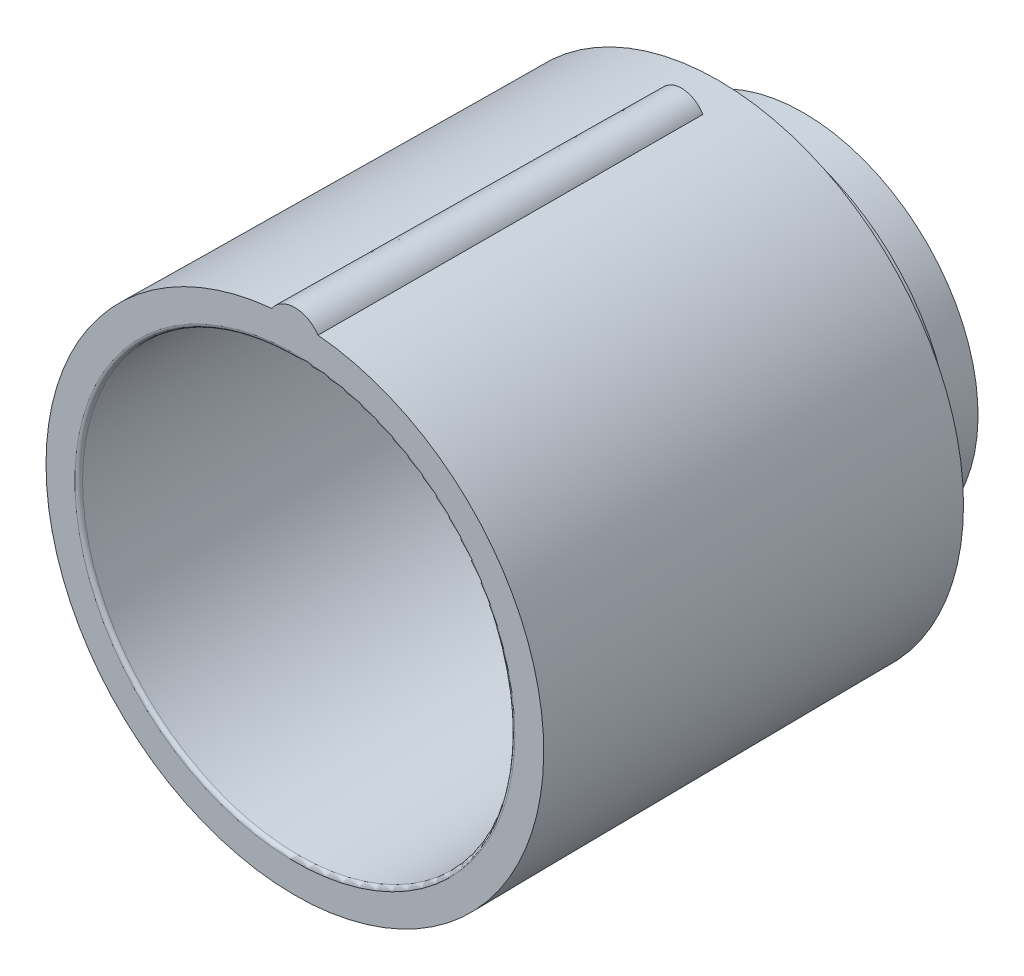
ISO-10303-21;
HEADER;
FILE_DESCRIPTION(('STEP AP214'),'2;1');
FILE_NAME('part.step','',(''),(''),'','','');
FILE_SCHEMA(('AUTOMOTIVE_DESIGN { 1 0 10303 214 1 1 1 1 }'));
ENDSEC;
DATA;
#1=APPLICATION_CONTEXT('core data for automotive mechanical design processes');
#2=APPLICATION_PROTOCOL_DEFINITION('international standard','automotive_design',2000,#1);
#3=PRODUCT_CONTEXT('',#1,'mechanical');
#4=PRODUCT('Part','Part','',(#3));
#5=PRODUCT_RELATED_PRODUCT_CATEGORY('part','',(#4));
#6=PRODUCT_DEFINITION_FORMATION('','',#4);
#7=PRODUCT_DEFINITION_CONTEXT('part definition',#1,'design');
#8=PRODUCT_DEFINITION('design','',#6,#7);
#9=PRODUCT_DEFINITION_SHAPE('','',#8);
#10=(LENGTH_UNIT() NAMED_UNIT(*) SI_UNIT(.MILLI.,.METRE.));
#11=(NAMED_UNIT(*) PLANE_ANGLE_UNIT() SI_UNIT($,.RADIAN.));
#12=(NAMED_UNIT(*) SI_UNIT($,.STERADIAN.) SOLID_ANGLE_UNIT());
#13=UNCERTAINTY_MEASURE_WITH_UNIT(LENGTH_MEASURE(1.E-05),#10,'distance_accuracy_value','');
#14=(GEOMETRIC_REPRESENTATION_CONTEXT(3) GLOBAL_UNCERTAINTY_ASSIGNED_CONTEXT((#13)) GLOBAL_UNIT_ASSIGNED_CONTEXT((#10,
#11,#12)) REPRESENTATION_CONTEXT('',''));
#15=CARTESIAN_POINT('',(0.,0.,0.));
#16=DIRECTION('',(0.,0.,1.));
#17=DIRECTION('',(1.,0.,0.));
#18=AXIS2_PLACEMENT_3D('',#15,#16,#17);
#19=CARTESIAN_POINT('',(-4.60877656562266,-6.39792561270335,-1.81185355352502));
#20=CARTESIAN_POINT('',(-4.758225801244,-6.61568560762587,-1.90467755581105));
#21=CARTESIAN_POINT('',(-4.7758242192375,-6.60596960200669,-1.62545241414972));
#22=CARTESIAN_POINT('',(-4.52098529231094,-6.47560029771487,-1.80760068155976));
#23=CARTESIAN_POINT('',(-4.66651668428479,-6.68203026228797,-1.87922751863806));
#24=CARTESIAN_POINT('',(-4.67595735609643,-6.67826907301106,-1.61694667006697));
#25=CARTESIAN_POINT('',(-4.43082266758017,-6.55143818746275,-1.80463493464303));
#26=CARTESIAN_POINT('',(-4.5677713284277,-6.75023954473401,-1.85801826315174));
#27=CARTESIAN_POINT('',(-4.57431138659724,-6.74835870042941,-1.61101517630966));
#28=CARTESIAN_POINT('',(-4.2461139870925,-6.6989744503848,-1.80083396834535));
#29=CARTESIAN_POINT('',(-4.3665553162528,-6.88225085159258,-1.82408433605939));
#30=CARTESIAN_POINT('',(-4.36789479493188,-6.88383310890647,-1.60341324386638));
#31=CARTESIAN_POINT('',(-4.15157199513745,-6.77067652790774,-1.79999681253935));
#32=CARTESIAN_POINT('',(-4.26337775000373,-6.94694517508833,-1.81067048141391));
#33=CARTESIAN_POINT('',(-4.26312710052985,-6.94922211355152,-1.60173893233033));
#34=CARTESIAN_POINT('',(-3.94776070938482,-6.91719698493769,-1.80000353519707));
#35=CARTESIAN_POINT('',(-4.04332933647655,-7.07763401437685,-1.7887953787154));
#36=CARTESIAN_POINT('',(-4.03913119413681,-7.08201116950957,-1.60175237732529));
#37=CARTESIAN_POINT('',(-3.83800995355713,-6.99150195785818,-1.80104076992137));
#38=CARTESIAN_POINT('',(-3.92476635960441,-7.14428192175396,-1.78049081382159));
#39=CARTESIAN_POINT('',(-3.91957232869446,-7.14885237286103,-1.60382684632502));
#40=CARTESIAN_POINT('',(-3.61365164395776,-7.1342251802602,-1.80482399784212));
#41=CARTESIAN_POINT('',(-3.68456494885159,-7.27107351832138,-1.7693490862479));
#42=CARTESIAN_POINT('',(-3.67723005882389,-7.27640579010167,-1.61139330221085));
#43=CARTESIAN_POINT('',(-3.49904016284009,-7.20263852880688,-1.80757139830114));
#44=CARTESIAN_POINT('',(-3.56226261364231,-7.33191838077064,-1.76623903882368));
#45=CARTESIAN_POINT('',(-3.55444407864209,-7.33711290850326,-1.61688810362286));
#46=CARTESIAN_POINT('',(-3.19511052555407,-7.37236336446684,-1.81657149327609));
#47=CARTESIAN_POINT('',(-3.24424708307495,-7.47979300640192,-1.76369267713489));
#48=CARTESIAN_POINT('',(-3.2313678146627,-7.48680676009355,-1.63488829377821));
#49=CARTESIAN_POINT('',(-3.00232593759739,-7.46870867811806,-1.8239386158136));
#50=CARTESIAN_POINT('',(-3.04108900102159,-7.56497497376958,-1.76704272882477));
#51=CARTESIAN_POINT('',(-3.02888620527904,-7.57083762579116,-1.6496225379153));
#52=CARTESIAN_POINT('',(-2.60706791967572,-7.64365422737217,-1.84145385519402));
#53=CARTESIAN_POINT('',(-2.63058675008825,-7.71694694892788,-1.7814275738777));
#54=CARTESIAN_POINT('',(-2.61812723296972,-7.72219484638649,-1.68465301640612));
#55=CARTESIAN_POINT('',(-2.40458672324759,-7.7222399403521,-1.85160423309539));
#56=CARTESIAN_POINT('',(-2.42117382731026,-7.78531020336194,-1.79222966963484));
#57=CARTESIAN_POINT('',(-2.40984528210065,-7.78950753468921,-1.70495377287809));
#58=CARTESIAN_POINT('',(-1.99148575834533,-7.86051654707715,-1.87403300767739));
#59=CARTESIAN_POINT('',(-1.99911718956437,-7.90379689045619,-1.81922971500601));
#60=CARTESIAN_POINT('',(-1.98847565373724,-7.90718299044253,-1.7498113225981));
#61=CARTESIAN_POINT('',(-1.78084847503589,-7.92016392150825,-1.88631620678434));
#62=CARTESIAN_POINT('',(-1.78454501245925,-7.95498845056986,-1.83540827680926));
#63=CARTESIAN_POINT('',(-1.77537809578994,-7.95750673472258,-1.77437772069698));
#64=CARTESIAN_POINT('',(-1.46091972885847,-7.99451891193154,-1.90591920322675));
#65=CARTESIAN_POINT('',(-1.46019891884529,-8.01831635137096,-1.86257544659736));
#66=CARTESIAN_POINT('',(-1.45367704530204,-8.01993260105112,-1.81358371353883));
#67=CARTESIAN_POINT('',(-1.35366081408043,-8.0167783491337,-1.91264681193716));
#68=CARTESIAN_POINT('',(-1.35219354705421,-8.03715777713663,-1.87205543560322));
#69=CARTESIAN_POINT('',(-1.34614675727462,-8.03855948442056,-1.8270389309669));
#70=CARTESIAN_POINT('',(-1.13807141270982,-8.05619545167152,-1.92649227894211));
#71=CARTESIAN_POINT('',(-1.13579906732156,-8.07039879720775,-1.8918511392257));
#72=CARTESIAN_POINT('',(-1.1305311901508,-8.07146236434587,-1.854729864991));
#73=CARTESIAN_POINT('',(-1.02974096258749,-8.07335329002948,-1.93361012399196));
#74=CARTESIAN_POINT('',(-1.02718524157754,-8.08486827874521,-1.90218111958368));
#75=CARTESIAN_POINT('',(-1.02244593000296,-8.08573850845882,-1.86896555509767));
#76=CARTESIAN_POINT('',(-0.921011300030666,-8.08792181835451,-1.94092148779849));
#77=CARTESIAN_POINT('',(-0.918152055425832,-8.09712611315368,-1.91292158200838));
#78=CARTESIAN_POINT('',(-0.914158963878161,-8.09783450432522,-1.88358828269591));
#79=(BOUNDED_SURFACE() B_SPLINE_SURFACE(3,2,((#19,#20,#21),(#22,#23,#24),(#25,#26,#27),(#28,#29,
#30),(#31,#32,#33),(#34,#35,#36),(#37,#38,#39),(#40,#41,#42),(#43,#44,#45),(#46,#47,#48),(#49,
#50,#51),(#52,#53,#54),(#55,#56,#57),(#58,#59,#60),(#61,#62,#63),(#64,#65,#66),(#67,#68,#69),
(#70,#71,#72),(#73,#74,#75),(#76,#77,#78)),.UNSPECIFIED.,.F.,.F.,
.F.) B_SPLINE_SURFACE_WITH_KNOTS((4,2,2,2,2,2,2,2,2,4),(3,3),(0.,0.36157991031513,
0.72283076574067,1.12349232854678,1.52448402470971,2.166690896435,2.80942103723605,
3.45361762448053,3.77544419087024,4.09725984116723),(0.,1.),
.UNSPECIFIED.) GEOMETRIC_REPRESENTATION_ITEM() RATIONAL_B_SPLINE_SURFACE(((1.,0.581309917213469,
1.),(1.,0.606317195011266,1.),(1.,0.629321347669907,1.),(1.,0.672033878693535,1.),(1.,
0.691745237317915,1.),(1.,0.730637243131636,1.),(1.,0.749525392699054,1.),(1.,0.784692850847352,
1.),(1.,0.800969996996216,1.),(1.,0.840372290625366,1.),(1.,0.861726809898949,1.),(1.,
0.899495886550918,1.),(1.,0.915906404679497,1.),(1.,0.94427211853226,1.),(1.,0.956217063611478,
1.),(1.,0.970948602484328,1.),(1.,0.975326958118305,1.),(1.,0.983045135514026,1.),(1.,
0.986384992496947,1.),(1.,0.989215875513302,1.))) REPRESENTATION_ITEM('') SURFACE());
#80=CARTESIAN_POINT('',(-2.89128600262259,-7.40696491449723,-1.65382037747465));
#81=DIRECTION('',(-0.929119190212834,0.361970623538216,0.0755962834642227));
#82=DIRECTION('',(-0.363009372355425,-0.931785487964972,0.));
#83=AXIS2_PLACEMENT_3D('',#80,#81,#82);
#84=CIRCLE('',#83,0.2);
#85=CARTESIAN_POINT('',(-2.93957339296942,-7.49476152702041,-1.82691018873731));
#86=VERTEX_POINT('',#85);
#87=CARTESIAN_POINT('',(-2.96400838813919,-7.59326684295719,-1.6555656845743));
#88=VERTEX_POINT('',#87);
#89=EDGE_CURVE('E12',#86,#88,#84,.T.);
#90=ORIENTED_EDGE('',*,*,#89,.F.);
#91=CARTESIAN_POINT('',(-4.60877656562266,-6.39792561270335,-1.81185355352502));
#92=CARTESIAN_POINT('',(-4.52098529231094,-6.47560029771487,-1.80760068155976));
#93=CARTESIAN_POINT('',(-4.43082266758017,-6.55143818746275,-1.80463493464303));
#94=CARTESIAN_POINT('',(-4.2461139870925,-6.6989744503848,-1.80083396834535));
#95=CARTESIAN_POINT('',(-4.15157199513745,-6.77067652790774,-1.79999681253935));
#96=CARTESIAN_POINT('',(-3.94776070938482,-6.9171969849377,-1.80000353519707));
#97=CARTESIAN_POINT('',(-3.83800995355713,-6.99150195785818,-1.80104076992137));
#98=CARTESIAN_POINT('',(-3.61365164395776,-7.1342251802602,-1.80482399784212));
#99=CARTESIAN_POINT('',(-3.49904016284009,-7.20263852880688,-1.80757139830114));
#100=CARTESIAN_POINT('',(-3.19511052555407,-7.37236336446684,-1.81657149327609));
#101=CARTESIAN_POINT('',(-3.00232593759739,-7.46870867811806,-1.8239386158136));
#102=CARTESIAN_POINT('',(-2.60706791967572,-7.64365422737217,-1.84145385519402));
#103=CARTESIAN_POINT('',(-2.40458672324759,-7.7222399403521,-1.85160423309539));
#104=CARTESIAN_POINT('',(-1.99148575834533,-7.86051654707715,-1.87403300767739));
#105=CARTESIAN_POINT('',(-1.78084847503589,-7.92016392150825,-1.88631620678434));
#106=CARTESIAN_POINT('',(-1.46091972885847,-7.99451891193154,-1.90591920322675));
#107=CARTESIAN_POINT('',(-1.35366081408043,-8.0167783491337,-1.91264681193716));
#108=CARTESIAN_POINT('',(-1.13807141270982,-8.05619545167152,-1.92649227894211));
#109=CARTESIAN_POINT('',(-1.02974096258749,-8.07335329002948,-1.93361012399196));
#110=CARTESIAN_POINT('',(-0.921011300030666,-8.08792181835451,-1.94092148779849));
#111=B_SPLINE_CURVE_WITH_KNOTS('',3,(#91,#92,#93,#94,#95,#96,#97,#98,#99,#100,#101,#102,#103,
#104,#105,#106,#107,#108,#109,#110),.UNSPECIFIED.,.F.,.F.,(4,2,2,2,2,2,2,2,2,4),(0.,
0.36157991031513,0.72283076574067,1.12349232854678,1.52448402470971,2.166690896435,
2.80942103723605,3.45361762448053,3.77544419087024,4.09725984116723),.UNSPECIFIED.);
#112=CARTESIAN_POINT('',(-4.05493752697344,-6.84014729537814,-1.8));
#113=VERTEX_POINT('',#112);
#114=EDGE_CURVE('E424',#113,#86,#111,.T.);
#115=ORIENTED_EDGE('',*,*,#114,.F.);
#116=CARTESIAN_POINT('',(-4.05493752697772,-6.84014729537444,-1.6));
#117=DIRECTION('',(-0.860207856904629,0.509943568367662,0.));
#118=DIRECTION('',(-0.509943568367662,-0.86020785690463,0.));
#119=AXIS2_PLACEMENT_3D('',#116,#117,#118);
#120=CIRCLE('',#119,0.2);
#121=CARTESIAN_POINT('',(-4.15692235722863,-7.01218231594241,-1.60174530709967));
#122=VERTEX_POINT('',#121);
#123=EDGE_CURVE('E44',#113,#122,#120,.T.);
#124=ORIENTED_EDGE('',*,*,#123,.T.);
#125=CARTESIAN_POINT('',(-0.914158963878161,-8.09783450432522,-1.88358828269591));
#126=CARTESIAN_POINT('',(-1.02244593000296,-8.08573850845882,-1.86896555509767));
#127=CARTESIAN_POINT('',(-1.1305311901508,-8.07146236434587,-1.854729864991));
#128=CARTESIAN_POINT('',(-1.34614675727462,-8.03855948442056,-1.8270389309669));
#129=CARTESIAN_POINT('',(-1.45367704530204,-8.01993260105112,-1.81358371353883));
#130=CARTESIAN_POINT('',(-1.77537809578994,-7.95750673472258,-1.77437772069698));
#131=CARTESIAN_POINT('',(-1.98847565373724,-7.90718299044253,-1.7498113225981));
#132=CARTESIAN_POINT('',(-2.40984528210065,-7.78950753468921,-1.70495377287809));
#133=CARTESIAN_POINT('',(-2.61812723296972,-7.72219484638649,-1.68465301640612));
#134=CARTESIAN_POINT('',(-3.02888620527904,-7.57083762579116,-1.6496225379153));
#135=CARTESIAN_POINT('',(-3.2313678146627,-7.48680676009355,-1.63488829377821));
#136=CARTESIAN_POINT('',(-3.55444407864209,-7.33711290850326,-1.61688810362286));
#137=CARTESIAN_POINT('',(-3.67723005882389,-7.27640579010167,-1.61139330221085));
#138=CARTESIAN_POINT('',(-3.91957232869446,-7.14885237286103,-1.60382684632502));
#139=CARTESIAN_POINT('',(-4.03913119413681,-7.08201116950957,-1.60175237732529));
#140=CARTESIAN_POINT('',(-4.26312710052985,-6.94922211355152,-1.60173893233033));
#141=CARTESIAN_POINT('',(-4.36789479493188,-6.88383310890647,-1.60341324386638));
#142=CARTESIAN_POINT('',(-4.57431138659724,-6.74835870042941,-1.61101517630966));
#143=CARTESIAN_POINT('',(-4.67595735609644,-6.67826907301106,-1.61694667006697));
#144=CARTESIAN_POINT('',(-4.7758242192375,-6.60596960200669,-1.62545241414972));
#145=B_SPLINE_CURVE_WITH_KNOTS('',3,(#125,#126,#127,#128,#129,#130,#131,#132,#133,#134,#135,
#136,#137,#138,#139,#140,#141,#142,#143,#144),.UNSPECIFIED.,.F.,.F.,(4,2,2,2,2,2,2,2,2,4),(0.,
0.321815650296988,0.643642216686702,1.28783880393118,1.93056894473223,2.57277581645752,
2.97376751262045,3.37442907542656,3.7356799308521,4.09725984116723),.UNSPECIFIED.);
#146=EDGE_CURVE('E205',#88,#122,#145,.T.);
#147=ORIENTED_EDGE('',*,*,#146,.F.);
#148=EDGE_LOOP('',(#90,#115,#124,#147));
#149=FACE_BOUND('',#148,.T.);
#150=ADVANCED_FACE('F36',(#149),#79,.F.);
#151=CARTESIAN_POINT('',(0.,0.,-1.6));
#152=DIRECTION('',(0.,0.,1.));
#153=DIRECTION('',(1.,0.,0.));
#154=AXIS2_PLACEMENT_3D('',#151,#152,#153);
#155=TOROIDAL_SURFACE('',#154,7.951737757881,0.2);
#156=ORIENTED_EDGE('',*,*,#123,.F.);
#157=CARTESIAN_POINT('',(0.,0.,-1.8));
#158=DIRECTION('',(0.,0.,1.));
#159=DIRECTION('',(1.,0.,0.));
#160=AXIS2_PLACEMENT_3D('',#157,#158,#159);
#161=CIRCLE('',#160,7.951737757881);
#162=CARTESIAN_POINT('',(4.05493752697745,-6.8401472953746,-1.8));
#163=VERTEX_POINT('',#162);
#164=EDGE_CURVE('E415',#163,#113,#161,.T.);
#165=ORIENTED_EDGE('',*,*,#164,.F.);
#166=CARTESIAN_POINT('',(4.05493752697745,-6.8401472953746,-1.6));
#167=DIRECTION('',(-0.860207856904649,-0.509943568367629,0.));
#168=DIRECTION('',(0.509943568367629,-0.860207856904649,0.));
#169=AXIS2_PLACEMENT_3D('',#166,#167,#168);
#170=CIRCLE('',#169,0.2);
#171=CARTESIAN_POINT('',(4.15692235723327,-7.01218231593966,-1.60174530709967));
#172=VERTEX_POINT('',#171);
#173=EDGE_CURVE('E57',#163,#172,#170,.T.);
#174=ORIENTED_EDGE('',*,*,#173,.T.);
#175=CARTESIAN_POINT('',(0.,0.,-1.60174530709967));
#176=DIRECTION('',(0.,0.,-1.));
#177=DIRECTION('',(-1.,0.,0.));
#178=AXIS2_PLACEMENT_3D('',#175,#176,#177);
#179=CIRCLE('',#178,8.15173014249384);
#180=EDGE_CURVE('E210',#122,#172,#179,.T.);
#181=ORIENTED_EDGE('',*,*,#180,.F.);
#182=EDGE_LOOP('',(#156,#165,#174,#181));
#183=FACE_BOUND('',#182,.T.);
#184=ADVANCED_FACE('F38',(#183),#155,.F.);
#185=CARTESIAN_POINT('',(4.77582422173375,-6.6059696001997,-1.62545241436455));
#186=CARTESIAN_POINT('',(4.75822580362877,-6.61568560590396,-1.90467755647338));
#187=CARTESIAN_POINT('',(4.60877656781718,-6.39792561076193,-1.81185355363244));
#188=CARTESIAN_POINT('',(4.67595735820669,-6.67826907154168,-1.61694667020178));
#189=CARTESIAN_POINT('',(4.66651668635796,-6.68203026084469,-1.87922751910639));
#190=CARTESIAN_POINT('',(4.52098529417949,-6.47560029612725,-1.80760068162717));
#191=CARTESIAN_POINT('',(4.57431138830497,-6.74835869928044,-1.6110151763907));
#192=CARTESIAN_POINT('',(4.56777133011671,-6.75023954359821,-1.85801826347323));
#193=CARTESIAN_POINT('',(4.43082266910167,-6.55143818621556,-1.80463493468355));
#194=CARTESIAN_POINT('',(4.36789479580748,-6.88383310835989,-1.60341324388));
#195=CARTESIAN_POINT('',(4.36655531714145,-6.88225085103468,-1.82408433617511));
#196=CARTESIAN_POINT('',(4.24611398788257,-6.69897444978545,-1.80083396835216));
#197=CARTESIAN_POINT('',(4.26312710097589,-6.94922211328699,-1.60173893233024));
#198=CARTESIAN_POINT('',(4.26337775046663,-6.94694517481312,-1.81067048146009));
#199=CARTESIAN_POINT('',(4.15157199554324,-6.77067652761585,-1.79999681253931));
#200=CARTESIAN_POINT('',(4.03913119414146,-7.08201116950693,-1.60175237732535));
#201=CARTESIAN_POINT('',(4.04332933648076,-7.07763401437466,-1.78879537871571));
#202=CARTESIAN_POINT('',(3.94776070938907,-6.91719698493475,-1.8000035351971));
#203=CARTESIAN_POINT('',(3.91957232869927,-7.1488523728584,-1.60382684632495));
#204=CARTESIAN_POINT('',(3.92476635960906,-7.14428192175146,-1.78049081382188));
#205=CARTESIAN_POINT('',(3.83800995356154,-6.99150195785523,-1.80104076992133));
#206=CARTESIAN_POINT('',(3.67723005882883,-7.27640579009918,-1.61139330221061));
#207=CARTESIAN_POINT('',(3.68456494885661,-7.27107351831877,-1.76934908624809));
#208=CARTESIAN_POINT('',(3.61365164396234,-7.13422518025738,-1.804823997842));
#209=CARTESIAN_POINT('',(3.554444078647,-7.33711290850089,-1.6168881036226));
#210=CARTESIAN_POINT('',(3.56226261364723,-7.33191838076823,-1.76623903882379));
#211=CARTESIAN_POINT('',(3.49904016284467,-7.20263852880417,-1.80757139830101));
#212=CARTESIAN_POINT('',(3.23136781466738,-7.48680676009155,-1.63488829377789));
#213=CARTESIAN_POINT('',(3.24424708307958,-7.47979300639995,-1.76369267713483));
#214=CARTESIAN_POINT('',(3.1951105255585,-7.37236336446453,-1.81657149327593));
#215=CARTESIAN_POINT('',(3.02888620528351,-7.57083762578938,-1.64962253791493));
#216=CARTESIAN_POINT('',(3.04108900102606,-7.56497497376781,-1.76704272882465));
#217=CARTESIAN_POINT('',(3.00232593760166,-7.468708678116,-1.82393861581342));
#218=CARTESIAN_POINT('',(2.61812723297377,-7.72219484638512,-1.68465301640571));
#219=CARTESIAN_POINT('',(2.63058675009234,-7.71694694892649,-1.7814275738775));
#220=CARTESIAN_POINT('',(2.60706791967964,-7.64365422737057,-1.84145385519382));
#221=CARTESIAN_POINT('',(2.40984528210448,-7.78950753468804,-1.70495377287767));
#222=CARTESIAN_POINT('',(2.42117382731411,-7.78531020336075,-1.79222966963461));
#223=CARTESIAN_POINT('',(2.40458672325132,-7.72223994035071,-1.85160423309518));
#224=CARTESIAN_POINT('',(1.98847565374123,-7.90718299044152,-1.74981132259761));
#225=CARTESIAN_POINT('',(1.99911718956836,-7.90379689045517,-1.8192297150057));
#226=CARTESIAN_POINT('',(1.99148575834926,-7.86051654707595,-1.87403300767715));
#227=CARTESIAN_POINT('',(1.77537809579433,-7.9575067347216,-1.77437772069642));
#228=CARTESIAN_POINT('',(1.78454501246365,-7.95498845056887,-1.83540827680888));
#229=CARTESIAN_POINT('',(1.78084847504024,-7.92016392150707,-1.88631620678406));
#230=CARTESIAN_POINT('',(1.45367704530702,-8.01993260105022,-1.81358371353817));
#231=CARTESIAN_POINT('',(1.46019891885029,-8.01831635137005,-1.8625754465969));
#232=CARTESIAN_POINT('',(1.46091972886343,-7.99451891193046,-1.90591920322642));
#233=CARTESIAN_POINT('',(1.34614675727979,-8.0385594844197,-1.82703893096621));
#234=CARTESIAN_POINT('',(1.35219354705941,-8.03715777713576,-1.87205543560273));
#235=CARTESIAN_POINT('',(1.3536608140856,-8.01677834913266,-1.91264681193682));
#236=CARTESIAN_POINT('',(1.13053119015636,-8.0714623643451,-1.85472986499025));
#237=CARTESIAN_POINT('',(1.13579906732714,-8.07039879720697,-1.89185113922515));
#238=CARTESIAN_POINT('',(1.13807141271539,-8.05619545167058,-1.92649227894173));
#239=CARTESIAN_POINT('',(1.02244593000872,-8.0857385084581,-1.86896555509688));
#240=CARTESIAN_POINT('',(1.02718524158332,-8.08486827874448,-1.90218111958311));
#241=CARTESIAN_POINT('',(1.02974096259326,-8.0733532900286,-1.93361012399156));
#242=CARTESIAN_POINT('',(0.914158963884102,-8.09783450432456,-1.88358828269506));
#243=CARTESIAN_POINT('',(0.918152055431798,-8.09712611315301,-1.91292158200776));
#244=CARTESIAN_POINT('',(0.921011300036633,-8.08792181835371,-1.94092148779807));
#245=(BOUNDED_SURFACE() B_SPLINE_SURFACE(3,2,((#185,#186,#187),(#188,#189,#190),(#191,#192,
#193),(#194,#195,#196),(#197,#198,#199),(#200,#201,#202),(#203,#204,#205),(#206,#207,#208),
(#209,#210,#211),(#212,#213,#214),(#215,#216,#217),(#218,#219,#220),(#221,#222,#223),(#224,#225,
#226),(#227,#228,#229),(#230,#231,#232),(#233,#234,#235),(#236,#237,#238),(#239,#240,#241),
(#242,#243,#244)),.UNSPECIFIED.,.F.,.F.,.F.) B_SPLINE_SURFACE_WITH_KNOTS((4,2,2,2,2,2,2,2,2,4),
(3,3),(0.,0.361579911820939,0.722830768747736,1.12349233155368,1.52448402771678,
2.16669089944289,2.80942104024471,3.45361762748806,3.77544419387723,4.09725984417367),(0.,1.),
.UNSPECIFIED.) GEOMETRIC_REPRESENTATION_ITEM() RATIONAL_B_SPLINE_SURFACE(((1.,0.581309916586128,
1.),(1.,0.606317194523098,1.),(1.,0.629321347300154,1.),(1.,0.672033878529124,1.),(1.,
0.691745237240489,1.),(1.,0.730637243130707,1.),(1.,0.749525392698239,1.),(1.,0.784692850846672,
1.),(1.,0.800969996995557,1.),(1.,0.840372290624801,1.),(1.,0.861726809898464,1.),(1.,
0.899495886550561,1.),(1.,0.91590640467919,1.),(1.,0.944272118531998,1.),(1.,0.956217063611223,
1.),(1.,0.970948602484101,1.),(1.,0.975326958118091,1.),(1.,0.983045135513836,1.),(1.,
0.986384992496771,1.),(1.,0.989215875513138,1.))) REPRESENTATION_ITEM('') SURFACE());
#246=ORIENTED_EDGE('',*,*,#173,.F.);
#247=CARTESIAN_POINT('',(0.921011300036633,-8.08792181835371,-1.94092148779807));
#248=CARTESIAN_POINT('',(1.02974096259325,-8.0733532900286,-1.93361012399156));
#249=CARTESIAN_POINT('',(1.13807141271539,-8.05619545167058,-1.92649227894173));
#250=CARTESIAN_POINT('',(1.3536608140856,-8.01677834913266,-1.91264681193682));
#251=CARTESIAN_POINT('',(1.46091972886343,-7.99451891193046,-1.90591920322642));
#252=CARTESIAN_POINT('',(1.78084847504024,-7.92016392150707,-1.88631620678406));
#253=CARTESIAN_POINT('',(1.99148575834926,-7.86051654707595,-1.87403300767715));
#254=CARTESIAN_POINT('',(2.40458672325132,-7.72223994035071,-1.85160423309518));
#255=CARTESIAN_POINT('',(2.60706791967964,-7.64365422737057,-1.84145385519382));
#256=CARTESIAN_POINT('',(3.00232593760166,-7.468708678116,-1.82393861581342));
#257=CARTESIAN_POINT('',(3.1951105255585,-7.37236336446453,-1.81657149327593));
#258=CARTESIAN_POINT('',(3.49904016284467,-7.20263852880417,-1.80757139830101));
#259=CARTESIAN_POINT('',(3.61365164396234,-7.13422518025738,-1.804823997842));
#260=CARTESIAN_POINT('',(3.83800995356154,-6.99150195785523,-1.80104076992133));
#261=CARTESIAN_POINT('',(3.94776070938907,-6.91719698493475,-1.8000035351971));
#262=CARTESIAN_POINT('',(4.15157199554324,-6.77067652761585,-1.79999681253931));
#263=CARTESIAN_POINT('',(4.24611398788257,-6.69897444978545,-1.80083396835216));
#264=CARTESIAN_POINT('',(4.43082266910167,-6.55143818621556,-1.80463493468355));
#265=CARTESIAN_POINT('',(4.52098529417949,-6.47560029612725,-1.80760068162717));
#266=CARTESIAN_POINT('',(4.60877656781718,-6.39792561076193,-1.81185355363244));
#267=B_SPLINE_CURVE_WITH_KNOTS('',3,(#247,#248,#249,#250,#251,#252,#253,#254,#255,#256,#257,
#258,#259,#260,#261,#262,#263,#264,#265,#266),.UNSPECIFIED.,.F.,.F.,(4,2,2,2,2,2,2,2,2,4),(0.,
0.321815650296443,0.64364221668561,1.28783880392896,1.93056894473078,2.57277581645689,
2.97376751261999,3.37442907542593,3.73567993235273,4.09725984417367),.UNSPECIFIED.);
#268=CARTESIAN_POINT('',(2.93957339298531,-7.49476152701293,-1.82691018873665));
#269=VERTEX_POINT('',#268);
#270=EDGE_CURVE('E420',#269,#163,#267,.T.);
#271=ORIENTED_EDGE('',*,*,#270,.F.);
#272=CARTESIAN_POINT('',(2.89128600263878,-7.40696491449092,-1.65382037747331));
#273=DIRECTION('',(-0.929119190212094,-0.361970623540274,-0.0755962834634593));
#274=DIRECTION('',(0.363009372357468,-0.931785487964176,0.));
#275=AXIS2_PLACEMENT_3D('',#272,#273,#274);
#276=CIRCLE('',#275,0.2);
#277=CARTESIAN_POINT('',(2.96400838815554,-7.59326684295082,-1.65556568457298));
#278=VERTEX_POINT('',#277);
#279=EDGE_CURVE('E417',#269,#278,#276,.T.);
#280=ORIENTED_EDGE('',*,*,#279,.T.);
#281=CARTESIAN_POINT('',(4.77582422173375,-6.6059696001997,-1.62545241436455));
#282=CARTESIAN_POINT('',(4.67595735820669,-6.67826907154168,-1.61694667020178));
#283=CARTESIAN_POINT('',(4.57431138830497,-6.74835869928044,-1.6110151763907));
#284=CARTESIAN_POINT('',(4.36789479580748,-6.88383310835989,-1.60341324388));
#285=CARTESIAN_POINT('',(4.26312710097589,-6.94922211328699,-1.60173893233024));
#286=CARTESIAN_POINT('',(4.03913119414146,-7.08201116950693,-1.60175237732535));
#287=CARTESIAN_POINT('',(3.91957232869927,-7.1488523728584,-1.60382684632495));
#288=CARTESIAN_POINT('',(3.67723005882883,-7.27640579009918,-1.61139330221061));
#289=CARTESIAN_POINT('',(3.554444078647,-7.33711290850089,-1.6168881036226));
#290=CARTESIAN_POINT('',(3.23136781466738,-7.48680676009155,-1.63488829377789));
#291=CARTESIAN_POINT('',(3.02888620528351,-7.57083762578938,-1.64962253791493));
#292=CARTESIAN_POINT('',(2.61812723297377,-7.72219484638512,-1.68465301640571));
#293=CARTESIAN_POINT('',(2.40984528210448,-7.78950753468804,-1.70495377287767));
#294=CARTESIAN_POINT('',(1.98847565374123,-7.90718299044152,-1.74981132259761));
#295=CARTESIAN_POINT('',(1.77537809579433,-7.9575067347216,-1.77437772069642));
#296=CARTESIAN_POINT('',(1.45367704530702,-8.01993260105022,-1.81358371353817));
#297=CARTESIAN_POINT('',(1.34614675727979,-8.0385594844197,-1.82703893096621));
#298=CARTESIAN_POINT('',(1.13053119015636,-8.0714623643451,-1.85472986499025));
#299=CARTESIAN_POINT('',(1.02244593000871,-8.0857385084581,-1.86896555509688));
#300=CARTESIAN_POINT('',(0.914158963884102,-8.09783450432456,-1.88358828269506));
#301=B_SPLINE_CURVE_WITH_KNOTS('',3,(#281,#282,#283,#284,#285,#286,#287,#288,#289,#290,#291,
#292,#293,#294,#295,#296,#297,#298,#299,#300),.UNSPECIFIED.,.F.,.F.,(4,2,2,2,2,2,2,2,2,4),(0.,
0.361579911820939,0.722830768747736,1.12349233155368,1.52448402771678,2.16669089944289,
2.80942104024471,3.45361762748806,3.77544419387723,4.09725984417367),.UNSPECIFIED.);
#302=EDGE_CURVE('E219',#172,#278,#301,.T.);
#303=ORIENTED_EDGE('',*,*,#302,.F.);
#304=EDGE_LOOP('',(#246,#271,#280,#303));
#305=FACE_BOUND('',#304,.T.);
#306=ADVANCED_FACE('F180',(#305),#245,.F.);
#307=CARTESIAN_POINT('',(3.50245216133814,-7.02163513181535,-1.96971061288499));
#308=CARTESIAN_POINT('',(3.4932355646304,-7.02826138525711,-1.8530290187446));
#309=CARTESIAN_POINT('',(3.54844331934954,-7.11455134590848,-1.7960238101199));
#310=CARTESIAN_POINT('',(3.60365107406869,-7.20084130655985,-1.73901860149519));
#311=CARTESIAN_POINT('',(3.66681156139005,-7.27852958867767,-1.8));
#312=CARTESIAN_POINT('',(3.44802276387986,-7.06077026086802,-1.9763693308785));
#313=CARTESIAN_POINT('',(3.4408948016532,-7.06575826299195,-1.86360460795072));
#314=CARTESIAN_POINT('',(3.49216755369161,-7.14813172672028,-1.80547469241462));
#315=CARTESIAN_POINT('',(3.54435555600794,-7.2299587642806,-1.74722610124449));
#316=CARTESIAN_POINT('',(3.60490025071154,-7.30972146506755,-1.8));
#317=CARTESIAN_POINT('',(3.39284564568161,-7.0990529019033,-1.98160981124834));
#318=CARTESIAN_POINT('',(3.38697474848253,-7.10307177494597,-1.87252416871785));
#319=CARTESIAN_POINT('',(3.4351595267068,-7.18154541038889,-1.81360709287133));
#320=CARTESIAN_POINT('',(3.48415616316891,-7.25955448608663,-1.7545999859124));
#321=CARTESIAN_POINT('',(3.54257458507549,-7.34012793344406,-1.8));
#322=CARTESIAN_POINT('',(3.28114623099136,-7.17380187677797,-1.98985883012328));
#323=CARTESIAN_POINT('',(3.27742654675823,-7.17620247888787,-1.88759586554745));
#324=CARTESIAN_POINT('',(3.31990141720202,-7.2475485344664,-1.82776441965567));
#325=CARTESIAN_POINT('',(3.36322884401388,-7.31840601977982,-1.76781870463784));
#326=CARTESIAN_POINT('',(3.41723123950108,-7.39931245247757,-1.8));
#327=CARTESIAN_POINT('',(3.22462441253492,-7.21026884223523,-1.99286814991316));
#328=CARTESIAN_POINT('',(3.22167171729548,-7.21214270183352,-1.89380923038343));
#329=CARTESIAN_POINT('',(3.26165177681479,-7.28013825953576,-1.83379008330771));
#330=CARTESIAN_POINT('',(3.30234128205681,-7.34774823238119,-1.77370413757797));
#331=CARTESIAN_POINT('',(3.35421380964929,-7.42809106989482,-1.8));
#332=CARTESIAN_POINT('',(3.11038702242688,-7.28127815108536,-1.9972616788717));
#333=CARTESIAN_POINT('',(3.10883738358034,-7.28220336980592,-1.90422050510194));
#334=CARTESIAN_POINT('',(3.14413380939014,-7.34400474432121,-1.84426568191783));
#335=CARTESIAN_POINT('',(3.18011086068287,-7.40543625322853,-1.7842537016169));
#336=CARTESIAN_POINT('',(3.22762384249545,-7.48396489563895,-1.8));
#337=CARTESIAN_POINT('',(3.05267230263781,-7.31582180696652,-1.99864700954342));
#338=CARTESIAN_POINT('',(3.05166946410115,-7.31641139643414,-1.90845301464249));
#339=CARTESIAN_POINT('',(3.0848662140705,-7.37528239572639,-1.84871670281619));
#340=CARTESIAN_POINT('',(3.11866010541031,-7.43384796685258,-1.78894273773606));
#341=CARTESIAN_POINT('',(3.16405171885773,-7.51106125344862,-1.8));
#342=CARTESIAN_POINT('',(2.93610006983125,-7.3829572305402,-2.000101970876));
#343=CARTESIAN_POINT('',(2.93609334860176,-7.38294917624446,-1.91532234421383));
#344=CARTESIAN_POINT('',(2.96535535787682,-7.43634978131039,-1.85633599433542));
#345=CARTESIAN_POINT('',(2.99521089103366,-7.48944740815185,-1.79731139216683));
#346=CARTESIAN_POINT('',(3.03637100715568,-7.56357831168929,-1.8));
#347=CARTESIAN_POINT('',(2.87724244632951,-7.41554880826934,-2.00017147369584));
#348=CARTESIAN_POINT('',(2.87761272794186,-7.41534595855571,-1.91797978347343));
#349=CARTESIAN_POINT('',(2.90511200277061,-7.46613937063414,-1.85950414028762));
#350=CARTESIAN_POINT('',(2.93312747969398,-7.51668776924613,-1.80100699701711));
#351=CARTESIAN_POINT('',(2.97226236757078,-7.58899884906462,-1.8));
#352=CARTESIAN_POINT('',(2.69952283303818,-7.51008716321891,-1.99877709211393));
#353=CARTESIAN_POINT('',(2.70169379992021,-7.50894386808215,-1.92398059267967));
#354=CARTESIAN_POINT('',(2.72348296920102,-7.55282342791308,-1.86741065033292));
#355=CARTESIAN_POINT('',(2.74731427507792,-7.59572570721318,-1.81074990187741));
#356=CARTESIAN_POINT('',(2.7796925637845,-7.66254811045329,-1.8));
#357=CARTESIAN_POINT('',(2.57907838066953,-7.56906829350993,-1.99572303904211));
#358=CARTESIAN_POINT('',(2.5815139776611,-7.56791975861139,-1.92551362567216));
#359=CARTESIAN_POINT('',(2.60075025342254,-7.6072785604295,-1.87058716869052));
#360=CARTESIAN_POINT('',(2.62158997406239,-7.64597986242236,-1.81563656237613));
#361=CARTESIAN_POINT('',(2.6505052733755,-7.70817707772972,-1.8));
#362=CARTESIAN_POINT('',(2.33461272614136,-7.67879175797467,-1.98657670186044));
#363=CARTESIAN_POINT('',(2.33770134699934,-7.67746017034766,-1.92497432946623));
#364=CARTESIAN_POINT('',(2.35222238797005,-7.70893273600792,-1.87393211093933));
#365=CARTESIAN_POINT('',(2.36830916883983,-7.73976650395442,-1.82287135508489));
#366=CARTESIAN_POINT('',(2.39058293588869,-7.79270772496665,-1.8));
#367=CARTESIAN_POINT('',(2.21059150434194,-7.72953404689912,-1.98048440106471));
#368=CARTESIAN_POINT('',(2.2137237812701,-7.72830506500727,-1.92294655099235));
#369=CARTESIAN_POINT('',(2.22642722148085,-7.7561317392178,-1.87410051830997));
#370=CARTESIAN_POINT('',(2.24037241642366,-7.78353299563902,-1.8252629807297));
#371=CARTESIAN_POINT('',(2.25984788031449,-7.8316093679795,-1.8));
#372=CARTESIAN_POINT('',(2.00664958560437,-7.80511758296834,-1.96874630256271));
#373=CARTESIAN_POINT('',(2.00958143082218,-7.80407324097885,-1.91750436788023));
#374=CARTESIAN_POINT('',(2.01993267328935,-7.82659288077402,-1.87254616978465));
#375=CARTESIAN_POINT('',(2.03076186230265,-7.84895048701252,-1.82759209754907));
#376=CARTESIAN_POINT('',(2.04640833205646,-7.88935635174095,-1.8));
#377=CARTESIAN_POINT('',(1.92763690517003,-7.83253478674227,-1.96379023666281));
#378=CARTESIAN_POINT('',(1.93056808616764,-7.83154346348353,-1.9149071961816));
#379=CARTESIAN_POINT('',(1.94001758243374,-7.85219275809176,-1.87150910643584));
#380=CARTESIAN_POINT('',(1.94987729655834,-7.87271890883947,-1.82811814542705));
#381=CARTESIAN_POINT('',(1.96408234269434,-7.91025128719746,-1.8));
#382=CARTESIAN_POINT('',(1.76859429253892,-7.88402664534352,-1.95314147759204));
#383=CARTESIAN_POINT('',(1.7715323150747,-7.88311753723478,-1.90886666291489));
#384=CARTESIAN_POINT('',(1.7793054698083,-7.90032483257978,-1.86870110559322));
#385=CARTESIAN_POINT('',(1.78748659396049,-7.91741022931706,-1.82854271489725));
#386=CARTESIAN_POINT('',(1.79901685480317,-7.94941719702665,-1.8));
#387=CARTESIAN_POINT('',(1.68856453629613,-7.90810186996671,-1.94744891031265));
#388=CARTESIAN_POINT('',(1.6914467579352,-7.90726119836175,-1.90542513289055));
#389=CARTESIAN_POINT('',(1.69850860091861,-7.92285755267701,-1.86693029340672));
#390=CARTESIAN_POINT('',(1.7059138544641,-7.93836725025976,-1.82844470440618));
#391=CARTESIAN_POINT('',(1.71627742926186,-7.96768861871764,-1.8));
#392=CARTESIAN_POINT('',(1.44712055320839,-7.97526723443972,-1.9294608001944));
#393=CARTESIAN_POINT('',(1.45037317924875,-7.97443962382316,-1.89408567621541));
#394=CARTESIAN_POINT('',(1.45493297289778,-7.98577117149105,-1.86071111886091));
#395=CARTESIAN_POINT('',(1.46086577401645,-7.99674402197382,-1.82737066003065));
#396=CARTESIAN_POINT('',(1.4674948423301,-8.01857886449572,-1.8));
#397=CARTESIAN_POINT('',(1.28432897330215,-8.01330544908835,-1.91625347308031));
#398=CARTESIAN_POINT('',(1.28717506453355,-8.01270010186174,-1.88512339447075));
#399=CARTESIAN_POINT('',(1.29094628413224,-8.02147536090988,-1.85535576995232));
#400=CARTESIAN_POINT('',(1.29563619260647,-8.03008393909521,-1.82562116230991));
#401=CARTESIAN_POINT('',(1.30086372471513,-8.04728005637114,-1.8));
#402=CARTESIAN_POINT('',(0.981246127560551,-8.07091314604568,-1.89040507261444));
#403=CARTESIAN_POINT('',(0.983519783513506,-8.07053534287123,-1.86693203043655));
#404=CARTESIAN_POINT('',(0.985930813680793,-8.07559230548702,-1.84401798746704));
#405=CARTESIAN_POINT('',(0.988992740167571,-8.08053689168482,-1.82112909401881));
#406=CARTESIAN_POINT('',(0.99205088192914,-8.09066270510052,-1.8));
#407=CARTESIAN_POINT('',(0.841295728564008,-8.09241098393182,-1.87798304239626));
#408=CARTESIAN_POINT('',(0.84320363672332,-8.09215263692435,-1.8579462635));
#409=CARTESIAN_POINT('',(0.845200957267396,-8.09580839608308,-1.83825458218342));
#410=CARTESIAN_POINT('',(0.84759859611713,-8.09942111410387,-1.8185802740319));
#411=CARTESIAN_POINT('',(0.850002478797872,-8.10681200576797,-1.8));
#412=CARTESIAN_POINT('',(0.560328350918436,-8.1254516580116,-1.85246432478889));
#413=CARTESIAN_POINT('',(0.561705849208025,-8.12532352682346,-1.83922605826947));
#414=CARTESIAN_POINT('',(0.562805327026,-8.12689035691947,-1.82605164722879));
#415=CARTESIAN_POINT('',(0.564303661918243,-8.12841227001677,-1.81289439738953));
#416=CARTESIAN_POINT('',(0.565505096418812,-8.13160966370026,-1.8));
#417=CARTESIAN_POINT('',(0.419311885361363,-8.13699900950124,-1.83936794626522));
#418=CARTESIAN_POINT('',(0.42028055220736,-8.13693912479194,-1.8294776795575));
#419=CARTESIAN_POINT('',(0.421140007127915,-8.13776046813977,-1.81961242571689));
#420=CARTESIAN_POINT('',(0.4221564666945,-8.13857333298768,-1.80975428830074));
#421=CARTESIAN_POINT('',(0.423056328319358,-8.14026142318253,-1.8));
#422=CARTESIAN_POINT('',(0.19541312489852,-8.14738842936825,-1.81839783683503));
#423=CARTESIAN_POINT('',(0.195858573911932,-8.14737650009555,-1.81379797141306));
#424=CARTESIAN_POINT('',(0.19625295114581,-8.1475411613,-1.80919584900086));
#425=CARTESIAN_POINT('',(0.196700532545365,-8.14770447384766,-1.8045962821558));
#426=CARTESIAN_POINT('',(0.197096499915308,-8.14804426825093,-1.8));
#427=CARTESIAN_POINT('',(0.112663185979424,-8.14951293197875,-1.81060949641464));
#428=CARTESIAN_POINT('',(0.112907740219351,-8.14951079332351,-1.8079570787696));
#429=CARTESIAN_POINT('',(0.113146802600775,-8.14954141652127,-1.80530441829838));
#430=CARTESIAN_POINT('',(0.113391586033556,-8.14957195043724,-1.80265203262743));
#431=CARTESIAN_POINT('',(0.113630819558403,-8.14963524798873,-1.8));
#432=CARTESIAN_POINT('',(0.0199398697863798,-8.14997514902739,-1.80187783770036));
#433=CARTESIAN_POINT('',(0.0199826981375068,-8.14997504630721,-1.80140838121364));
#434=CARTESIAN_POINT('',(0.0200254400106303,-8.1499766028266,-1.80093891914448));
#435=CARTESIAN_POINT('',(0.020068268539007,-8.14997816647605,-1.80046946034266));
#436=CARTESIAN_POINT('',(0.0201110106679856,-8.14998138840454,-1.8));
#437=CARTESIAN_POINT('',(0.00996990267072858,-8.14999999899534,-1.80093891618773));
#438=CARTESIAN_POINT('',(0.00999129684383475,-8.15000000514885,-1.80070418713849));
#439=CARTESIAN_POINT('',(0.0100126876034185,-8.14999999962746,-1.80046945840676));
#440=CARTESIAN_POINT('',(0.0100340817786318,-8.15000000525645,-1.80023472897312));
#441=CARTESIAN_POINT('',(0.0100554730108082,-8.14999999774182,-1.8));
#442=CARTESIAN_POINT('',(-1.60344942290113E-13,-8.15,-1.8));
#443=CARTESIAN_POINT('',(-1.60344942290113E-13,-8.15,-1.8));
#444=CARTESIAN_POINT('',(-1.60344942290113E-13,-8.15,-1.8));
#445=CARTESIAN_POINT('',(-1.60344942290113E-13,-8.15,-1.8));
#446=CARTESIAN_POINT('',(-1.6074752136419E-13,-8.15,-1.8));
#447=(BOUNDED_SURFACE() B_SPLINE_SURFACE(3,2,((#307,#308,#309,#310,#311),(#312,#313,#314,#315,
#316),(#317,#318,#319,#320,#321),(#322,#323,#324,#325,#326),(#327,#328,#329,#330,#331),(#332,
#333,#334,#335,#336),(#337,#338,#339,#340,#341),(#342,#343,#344,#345,#346),(#347,#348,#349,#350,
#351),(#352,#353,#354,#355,#356),(#357,#358,#359,#360,#361),(#362,#363,#364,#365,#366),(#367,
#368,#369,#370,#371),(#372,#373,#374,#375,#376),(#377,#378,#379,#380,#381),(#382,#383,#384,#385,
#386),(#387,#388,#389,#390,#391),(#392,#393,#394,#395,#396),(#397,#398,#399,#400,#401),(#402,
#403,#404,#405,#406),(#407,#408,#409,#410,#411),(#412,#413,#414,#415,#416),(#417,#418,#419,#420,
#421),(#422,#423,#424,#425,#426),(#427,#428,#429,#430,#431),(#432,#433,#434,#435,#436),(#437,
#438,#439,#440,#441),(#442,#443,#444,#445,#446)),.UNSPECIFIED.,.F.,.F.,
.F.) B_SPLINE_SURFACE_WITH_KNOTS((4,2,2,2,2,2,2,2,2,2,2,2,2,4),(3,2,3),(0.,0.208718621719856,
0.417364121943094,0.625865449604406,0.834387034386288,1.24984354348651,1.66530233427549,
1.92491967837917,2.18449270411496,2.70356404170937,3.14374080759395,3.5837177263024,
3.84131750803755,3.8723524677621),(0.,0.5,1.),
.UNSPECIFIED.) GEOMETRIC_REPRESENTATION_ITEM() RATIONAL_B_SPLINE_SURFACE(((1.,0.862714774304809,
1.,0.862714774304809,1.),(1.,0.870539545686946,1.,0.870539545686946,1.),(1.,0.877546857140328,
1.,0.877546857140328,1.),(1.,0.890313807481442,1.,0.890313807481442,1.),(1.,0.896073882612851,
1.,0.896073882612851,1.),(1.,0.906734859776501,1.,0.906734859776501,1.),(1.,0.911636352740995,
1.,0.911636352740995,1.),(1.,0.920764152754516,1.,0.920764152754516,1.),(1.,0.924990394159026,
1.,0.924990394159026,1.),(1.,0.93683370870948,1.,0.93683370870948,1.),(1.,0.943653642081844,1.,
0.943653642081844,1.),(1.,0.95576324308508,1.,0.95576324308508,1.),(1.,0.961052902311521,1.,
0.961052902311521,1.),(1.,0.968663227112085,1.,0.968663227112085,1.),(1.,0.971353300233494,1.,
0.971353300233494,1.),(1.,0.976311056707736,1.,0.976311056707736,1.),(1.,0.978578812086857,1.,
0.978578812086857,1.),(1.,0.98481177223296,1.,0.98481177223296,1.),(1.,0.988207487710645,1.,
0.988207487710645,1.),(1.,0.993267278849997,1.,0.993267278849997,1.),(1.,0.99511610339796,1.,
0.99511610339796,1.),(1.,0.997936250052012,1.,0.997936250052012,1.),(1.,0.998907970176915,1.,
0.998907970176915,1.),(1.,0.999781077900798,1.,0.999781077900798,1.),(1.,0.999959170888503,1.,
0.999959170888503,1.),(1.,0.999997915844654,1.,0.999997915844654,1.),(1.,0.999999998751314,1.,
0.999999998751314,1.),(1.,1.,1.,1.,1.))) REPRESENTATION_ITEM('') SURFACE());
#448=CARTESIAN_POINT('',(0.0186920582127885,-8.14997856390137,-1.80000001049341));
#449=CARTESIAN_POINT('',(0.0186920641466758,-8.14997856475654,-1.80000000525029));
#450=CARTESIAN_POINT('',(0.0186920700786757,-8.14997856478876,-1.8));
#451=CARTESIAN_POINT('',(0.0287655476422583,-8.14995306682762,-1.80027669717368));
#452=CARTESIAN_POINT('',(0.0287523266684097,-8.1499560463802,-1.79994357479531));
#453=CARTESIAN_POINT('',(0.0287391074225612,-8.14995893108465,-1.79961045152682));
#454=CARTESIAN_POINT('',(0.0388391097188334,-8.1499055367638,-1.80055335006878));
#455=CARTESIAN_POINT('',(0.0388127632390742,-8.14991482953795,-1.79988712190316));
#456=CARTESIAN_POINT('',(0.0387862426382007,-8.14992070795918,-1.79922086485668));
#457=CARTESIAN_POINT('',(0.186014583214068,-8.14888929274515,-1.80459413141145));
#458=CARTESIAN_POINT('',(0.185811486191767,-8.1490397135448,-1.79906185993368));
#459=CARTESIAN_POINT('',(0.185576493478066,-8.14909070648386,-1.79352816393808));
#460=CARTESIAN_POINT('',(0.323108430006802,-8.14386234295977,-1.80834369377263));
#461=CARTESIAN_POINT('',(0.322947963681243,-8.14476049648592,-1.79828692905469));
#462=CARTESIAN_POINT('',(0.322322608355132,-8.14487456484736,-1.78821513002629));
#463=CARTESIAN_POINT('',(0.596797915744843,-8.12566912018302,-1.81558801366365));
#464=CARTESIAN_POINT('',(0.596506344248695,-8.12933029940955,-1.79670203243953));
#465=CARTESIAN_POINT('',(0.595514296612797,-8.1295634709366,-1.77748611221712));
#466=CARTESIAN_POINT('',(0.73339309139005,-8.11249660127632,-1.81908257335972));
#467=CARTESIAN_POINT('',(0.733352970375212,-8.11812686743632,-1.79588944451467));
#468=CARTESIAN_POINT('',(0.731959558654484,-8.11846324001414,-1.77207005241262));
#469=CARTESIAN_POINT('',(1.04879782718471,-8.07258134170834,-1.82659095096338));
#470=CARTESIAN_POINT('',(1.04962718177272,-8.08421489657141,-1.79389666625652));
#471=CARTESIAN_POINT('',(1.04744230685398,-8.08478214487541,-1.75925169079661));
#472=CARTESIAN_POINT('',(1.22720514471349,-8.04285377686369,-1.83041599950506));
#473=CARTESIAN_POINT('',(1.22918351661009,-8.05883633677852,-1.79267765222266));
#474=CARTESIAN_POINT('',(1.22621300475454,-8.0596716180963,-1.75176589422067));
#475=CARTESIAN_POINT('',(1.58093402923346,-7.96958256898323,-1.83653744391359));
#476=CARTESIAN_POINT('',(1.58529924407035,-7.99649472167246,-1.78994606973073));
#477=CARTESIAN_POINT('',(1.58166728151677,-7.99765415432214,-1.73609995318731));
#478=CARTESIAN_POINT('',(1.75625542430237,-7.92603815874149,-1.83883375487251));
#479=CARTESIAN_POINT('',(1.76288037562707,-7.95917312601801,-1.78842096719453));
#480=CARTESIAN_POINT('',(1.75835074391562,-7.96074656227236,-1.72791977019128));
#481=CARTESIAN_POINT('',(2.10268980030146,-7.82546922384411,-1.84105154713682));
#482=CARTESIAN_POINT('',(2.11425951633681,-7.87324486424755,-1.78481885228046));
#483=CARTESIAN_POINT('',(2.10880041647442,-7.87532462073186,-1.71036745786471));
#484=CARTESIAN_POINT('',(2.27380329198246,-7.76844634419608,-1.84097331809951));
#485=CARTESIAN_POINT('',(2.28914261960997,-7.82410942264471,-1.78271797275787));
#486=CARTESIAN_POINT('',(2.2825669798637,-7.82681168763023,-1.70099547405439));
#487=CARTESIAN_POINT('',(2.61078381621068,-7.64133254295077,-1.83723290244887));
#488=CARTESIAN_POINT('',(2.63439468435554,-7.71488153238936,-1.77748490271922));
#489=CARTESIAN_POINT('',(2.62633357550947,-7.71844268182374,-1.68025124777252));
#490=CARTESIAN_POINT('',(2.77665329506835,-7.57124782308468,-1.83357241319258));
#491=CARTESIAN_POINT('',(2.80596011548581,-7.6540449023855,-1.77430210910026));
#492=CARTESIAN_POINT('',(2.79633535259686,-7.65859199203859,-1.66887995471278));
#493=CARTESIAN_POINT('',(3.00133392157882,-7.46576706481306,-1.82438484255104));
#494=CARTESIAN_POINT('',(3.03628171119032,-7.56392160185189,-1.76839011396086));
#495=CARTESIAN_POINT('',(3.02757274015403,-7.56850227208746,-1.65051828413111));
#496=CARTESIAN_POINT('',(3.06267182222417,-7.4358518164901,-1.82142792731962));
#497=CARTESIAN_POINT('',(3.10013817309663,-7.53798241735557,-1.76656627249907));
#498=CARTESIAN_POINT('',(3.09080241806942,-7.54295094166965,-1.64519164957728));
#499=CARTESIAN_POINT('',(3.18445240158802,-7.37418989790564,-1.81436875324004));
#500=CARTESIAN_POINT('',(3.22720862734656,-7.48451265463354,-1.76239539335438));
#501=CARTESIAN_POINT('',(3.21647722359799,-7.49033123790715,-1.63374320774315));
#502=CARTESIAN_POINT('',(3.24489589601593,-7.34244504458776,-1.81026761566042));
#503=CARTESIAN_POINT('',(3.29051317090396,-7.45691434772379,-1.76003672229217));
#504=CARTESIAN_POINT('',(3.27892305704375,-7.46326437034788,-1.62762218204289));
#505=CARTESIAN_POINT('',(3.30492853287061,-7.30976036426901,-1.80545058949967));
#506=CARTESIAN_POINT('',(3.35297681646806,-7.42874838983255,-1.75733691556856));
#507=CARTESIAN_POINT('',(3.34098119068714,-7.43544297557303,-1.62098076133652));
#508=(BOUNDED_SURFACE() B_SPLINE_SURFACE(3,2,((#448,#449,#450),(#451,#452,#453),(#454,#455,
#456),(#457,#458,#459),(#460,#461,#462),(#463,#464,#465),(#466,#467,#468),(#469,#470,#471),
(#472,#473,#474),(#475,#476,#477),(#478,#479,#480),(#481,#482,#483),(#484,#485,#486),(#487,#488,
#489),(#490,#491,#492),(#493,#494,#495),(#496,#497,#498),(#499,#500,#501),(#502,#503,#504),
(#505,#506,#507)),.UNSPECIFIED.,.F.,.F.,.F.) B_SPLINE_SURFACE_WITH_KNOTS((4,2,2,2,2,2,2,2,2,4),
(3,3),(0.,0.0294251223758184,0.429905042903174,0.8306924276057,1.35905004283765,
1.88743700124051,2.41575950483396,2.94383179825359,3.14402244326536,3.34401759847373),(0.,1.),
.UNSPECIFIED.) GEOMETRIC_REPRESENTATION_ITEM() RATIONAL_B_SPLINE_SURFACE(((1.,0.999999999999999,
1.),(1.,0.999999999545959,1.),(1.,0.99999583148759,1.),(1.,0.999874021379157,1.),(1.,
0.998988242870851,1.),(1.,0.995662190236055,1.),(1.,0.99322072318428,1.),(1.,0.985722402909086,
1.),(1.,0.980080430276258,1.),(1.,0.965929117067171,1.),(1.,0.957419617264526,1.),(1.,
0.93732970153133,1.),(1.,0.925749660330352,1.),(1.,0.89919949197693,1.),(1.,0.884230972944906,
1.),(1.,0.86081837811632,1.),(1.,0.854093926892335,1.),(1.,0.840003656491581,1.),(1.,
0.832638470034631,1.),(1.,0.824914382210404,1.))) REPRESENTATION_ITEM('') SURFACE());
#509=ORIENTED_EDGE('',*,*,#279,.F.);
#510=CARTESIAN_POINT('',(3.30492853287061,-7.30976036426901,-1.80545058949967));
#511=CARTESIAN_POINT('',(3.24489589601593,-7.34244504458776,-1.81026761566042));
#512=CARTESIAN_POINT('',(3.18445240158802,-7.37418989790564,-1.81436875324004));
#513=CARTESIAN_POINT('',(3.06267182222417,-7.4358518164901,-1.82142792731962));
#514=CARTESIAN_POINT('',(3.00133392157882,-7.46576706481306,-1.82438484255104));
#515=CARTESIAN_POINT('',(2.77665329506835,-7.57124782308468,-1.83357241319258));
#516=CARTESIAN_POINT('',(2.61078381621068,-7.64133254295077,-1.83723290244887));
#517=CARTESIAN_POINT('',(2.27380329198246,-7.76844634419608,-1.84097331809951));
#518=CARTESIAN_POINT('',(2.10268980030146,-7.82546922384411,-1.84105154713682));
#519=CARTESIAN_POINT('',(1.75625542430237,-7.92603815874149,-1.83883375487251));
#520=CARTESIAN_POINT('',(1.58093402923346,-7.96958256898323,-1.83653744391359));
#521=CARTESIAN_POINT('',(1.22720514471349,-8.04285377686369,-1.83041599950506));
#522=CARTESIAN_POINT('',(1.04879782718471,-8.07258134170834,-1.82659095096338));
#523=CARTESIAN_POINT('',(0.73339309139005,-8.11249660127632,-1.81908257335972));
#524=CARTESIAN_POINT('',(0.596797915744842,-8.12566912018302,-1.81558801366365));
#525=CARTESIAN_POINT('',(0.323108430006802,-8.14386234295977,-1.80834369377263));
#526=CARTESIAN_POINT('',(0.186014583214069,-8.14888929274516,-1.80459413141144));
#527=CARTESIAN_POINT('',(0.0388391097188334,-8.1499055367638,-1.80055335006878));
#528=CARTESIAN_POINT('',(0.0287655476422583,-8.14995306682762,-1.80027669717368));
#529=CARTESIAN_POINT('',(0.0186920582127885,-8.14997856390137,-1.80000001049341));
#530=B_SPLINE_CURVE_WITH_KNOTS('',3,(#510,#511,#512,#513,#514,#515,#516,#517,#518,#519,#520,
#521,#522,#523,#524,#525,#526,#527,#528,#529),.UNSPECIFIED.,.F.,.F.,(4,2,2,2,2,2,2,2,2,4),(0.,
0.199995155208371,0.400185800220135,0.928258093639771,1.45658059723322,1.98496755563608,
2.51332517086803,2.91411255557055,3.31459247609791,3.34401759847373),.UNSPECIFIED.);
#531=CARTESIAN_POINT('',(0.0186920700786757,-8.14997856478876,-1.8));
#532=VERTEX_POINT('',#531);
#533=EDGE_CURVE('E269',#532,#269,#530,.F.);
#534=ORIENTED_EDGE('',*,*,#533,.F.);
#535=CARTESIAN_POINT('',(3.34098119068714,-7.43544297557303,-1.62098076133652));
#536=CARTESIAN_POINT('',(3.27892305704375,-7.46326437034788,-1.62762218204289));
#537=CARTESIAN_POINT('',(3.21647722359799,-7.49033123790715,-1.63374320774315));
#538=CARTESIAN_POINT('',(3.09080241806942,-7.54295094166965,-1.64519164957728));
#539=CARTESIAN_POINT('',(3.02757274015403,-7.56850227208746,-1.65051828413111));
#540=CARTESIAN_POINT('',(2.79633535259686,-7.65859199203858,-1.66887995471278));
#541=CARTESIAN_POINT('',(2.62633357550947,-7.71844268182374,-1.68025124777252));
#542=CARTESIAN_POINT('',(2.2825669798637,-7.82681168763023,-1.70099547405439));
#543=CARTESIAN_POINT('',(2.10880041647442,-7.87532462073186,-1.71036745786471));
#544=CARTESIAN_POINT('',(1.75835074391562,-7.96074656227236,-1.72791977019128));
#545=CARTESIAN_POINT('',(1.58166728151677,-7.99765415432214,-1.73609995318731));
#546=CARTESIAN_POINT('',(1.22621300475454,-8.0596716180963,-1.75176589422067));
#547=CARTESIAN_POINT('',(1.04744230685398,-8.08478214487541,-1.75925169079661));
#548=CARTESIAN_POINT('',(0.731959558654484,-8.11846324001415,-1.77207005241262));
#549=CARTESIAN_POINT('',(0.595514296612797,-8.1295634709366,-1.77748611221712));
#550=CARTESIAN_POINT('',(0.322322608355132,-8.14487456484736,-1.78821513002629));
#551=CARTESIAN_POINT('',(0.185576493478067,-8.14909070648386,-1.79352816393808));
#552=CARTESIAN_POINT('',(0.0387862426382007,-8.14992070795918,-1.79922086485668));
#553=CARTESIAN_POINT('',(0.0287391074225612,-8.14995893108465,-1.79961045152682));
#554=CARTESIAN_POINT('',(0.0186920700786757,-8.14997856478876,-1.8));
#555=B_SPLINE_CURVE_WITH_KNOTS('',3,(#535,#536,#537,#538,#539,#540,#541,#542,#543,#544,#545,
#546,#547,#548,#549,#550,#551,#552,#553,#554),.UNSPECIFIED.,.F.,.F.,(4,2,2,2,2,2,2,2,2,4),(0.,
0.199995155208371,0.400185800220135,0.928258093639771,1.45658059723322,1.98496755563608,
2.51332517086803,2.91411255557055,3.31459247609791,3.34401759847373),.UNSPECIFIED.);
#556=EDGE_CURVE('E224',#278,#532,#555,.T.);
#557=ORIENTED_EDGE('',*,*,#556,.F.);
#558=EDGE_LOOP('',(#509,#534,#557));
#559=FACE_BOUND('',#558,.T.);
#560=ADVANCED_FACE('F243',(#559),#508,.F.);
#561=CARTESIAN_POINT('',(-3.66681155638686,-7.27852959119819,-1.8));
#562=CARTESIAN_POINT('',(-3.60365106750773,-7.20084131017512,-1.73901860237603));
#563=CARTESIAN_POINT('',(-3.54844331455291,-7.11455134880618,-1.796023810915));
#564=CARTESIAN_POINT('',(-3.49323556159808,-7.02826138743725,-1.85302901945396));
#565=CARTESIAN_POINT('',(-3.50245216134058,-7.02163513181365,-1.96971061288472));
#566=CARTESIAN_POINT('',(-3.60490024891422,-7.30972146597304,-1.8));
#567=CARTESIAN_POINT('',(-3.54435555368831,-7.22995876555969,-1.74722610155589));
#568=CARTESIAN_POINT('',(-3.49216755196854,-7.14813172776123,-1.80547469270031));
#569=CARTESIAN_POINT('',(-3.4408948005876,-7.0657582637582,-1.86360460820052));
#570=CARTESIAN_POINT('',(-3.44802276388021,-7.06077026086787,-1.97636933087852));
#571=CARTESIAN_POINT('',(-3.5425745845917,-7.34012793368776,-1.8));
#572=CARTESIAN_POINT('',(-3.48415616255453,-7.25955448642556,-1.75459998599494));
#573=CARTESIAN_POINT('',(-3.43515952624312,-7.18154541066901,-1.81360709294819));
#574=CARTESIAN_POINT('',(-3.38697474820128,-7.10307177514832,-1.87252416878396));
#575=CARTESIAN_POINT('',(-3.39284564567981,-7.09905290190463,-1.98160981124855));
#576=CARTESIAN_POINT('',(-3.41723123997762,-7.39931245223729,-1.8));
#577=CARTESIAN_POINT('',(-3.363228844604,-7.3184060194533,-1.76781870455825));
#578=CARTESIAN_POINT('',(-3.31990141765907,-7.24754853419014,-1.82776441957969));
#579=CARTESIAN_POINT('',(-3.27742654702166,-7.17620247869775,-1.88759586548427));
#580=CARTESIAN_POINT('',(-3.28114623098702,-7.17380187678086,-1.98985883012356));
#581=CARTESIAN_POINT('',(-3.35421380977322,-7.42809106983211,-1.8));
#582=CARTESIAN_POINT('',(-3.3023412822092,-7.34774823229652,-1.77370413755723));
#583=CARTESIAN_POINT('',(-3.26165177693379,-7.28013825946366,-1.83379008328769));
#584=CARTESIAN_POINT('',(-3.2216717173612,-7.21214270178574,-1.89380923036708));
#585=CARTESIAN_POINT('',(-3.22462441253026,-7.21026884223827,-1.9928681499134));
#586=CARTESIAN_POINT('',(-3.22762384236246,-7.48396489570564,-1.8));
#587=CARTESIAN_POINT('',(-3.18011086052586,-7.40543625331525,-1.78425370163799));
#588=CARTESIAN_POINT('',(-3.14413380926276,-7.34400474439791,-1.84426568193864));
#589=CARTESIAN_POINT('',(-3.10883738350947,-7.28220336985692,-1.90422050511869));
#590=CARTESIAN_POINT('',(-3.11038702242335,-7.28127815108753,-1.9972616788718));
#591=CARTESIAN_POINT('',(-3.16405171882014,-7.51106125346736,-1.8));
#592=CARTESIAN_POINT('',(-3.11866010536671,-7.43384796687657,-1.78894273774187));
#593=CARTESIAN_POINT('',(-3.08486621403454,-7.37528239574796,-1.84871670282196));
#594=CARTESIAN_POINT('',(-3.05166946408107,-7.31641139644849,-1.9084530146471));
#595=CARTESIAN_POINT('',(-3.05267230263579,-7.31582180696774,-1.99864700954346));
#596=CARTESIAN_POINT('',(-3.03637100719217,-7.56357831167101,-1.8));
#597=CARTESIAN_POINT('',(-2.99521089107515,-7.48944740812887,-1.79731139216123));
#598=CARTESIAN_POINT('',(-2.96535535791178,-7.43634978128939,-1.85633599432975));
#599=CARTESIAN_POINT('',(-2.9360933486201,-7.38294917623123,-1.91532234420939));
#600=CARTESIAN_POINT('',(-2.9361000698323,-7.38295723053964,-2.00010197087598));
#601=CARTESIAN_POINT('',(-2.97226236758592,-7.5889988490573,-1.8));
#602=CARTESIAN_POINT('',(-2.93312747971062,-7.51668776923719,-1.80100699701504));
#603=CARTESIAN_POINT('',(-2.90511200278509,-7.46613937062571,-1.85950414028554));
#604=CARTESIAN_POINT('',(-2.87761272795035,-7.41534595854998,-1.91797978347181));
#605=CARTESIAN_POINT('',(-2.87724244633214,-7.41554880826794,-2.00017147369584));
#606=CARTESIAN_POINT('',(-2.77969256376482,-7.66254811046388,-1.8));
#607=CARTESIAN_POINT('',(-2.74731427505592,-7.59572570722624,-1.81074990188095));
#608=CARTESIAN_POINT('',(-2.72348296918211,-7.55282342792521,-1.86741065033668));
#609=CARTESIAN_POINT('',(-2.7016937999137,-7.50894386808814,-1.92398059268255));
#610=CARTESIAN_POINT('',(-2.6995228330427,-7.51008716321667,-1.99877709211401));
#611=CARTESIAN_POINT('',(-2.6505052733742,-7.70817707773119,-1.8));
#612=CARTESIAN_POINT('',(-2.62158997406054,-7.64597986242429,-1.81563656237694));
#613=CARTESIAN_POINT('',(-2.60075025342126,-7.60727856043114,-1.87058716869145));
#614=CARTESIAN_POINT('',(-2.58151397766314,-7.56791975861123,-1.92551362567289));
#615=CARTESIAN_POINT('',(-2.57907838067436,-7.56906829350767,-1.99572303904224));
#616=CARTESIAN_POINT('',(-2.3905829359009,-7.79270772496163,-1.8));
#617=CARTESIAN_POINT('',(-2.36830916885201,-7.73976650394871,-1.82287135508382));
#618=CARTESIAN_POINT('',(-2.35222238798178,-7.70893273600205,-1.87393211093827));
#619=CARTESIAN_POINT('',(-2.3377013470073,-7.67746017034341,-1.92497432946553));
#620=CARTESIAN_POINT('',(-2.33461272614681,-7.6787917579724,-1.98657670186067));
#621=CARTESIAN_POINT('',(-2.25984788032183,-7.83160936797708,-1.8));
#622=CARTESIAN_POINT('',(-2.24037241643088,-7.78353299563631,-1.82526298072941));
#623=CARTESIAN_POINT('',(-2.22642722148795,-7.75613173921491,-1.87410051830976));
#624=CARTESIAN_POINT('',(-2.21372378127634,-7.72830506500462,-1.9229465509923));
#625=CARTESIAN_POINT('',(-2.21059150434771,-7.72953404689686,-1.98048440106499));
#626=CARTESIAN_POINT('',(-2.04640833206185,-7.88935635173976,-1.8));
#627=CARTESIAN_POINT('',(-2.03076186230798,-7.84895048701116,-1.82759209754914));
#628=CARTESIAN_POINT('',(-2.01993267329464,-7.82659288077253,-1.87254616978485));
#629=CARTESIAN_POINT('',(-2.00958143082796,-7.80407324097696,-1.91750436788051));
#630=CARTESIAN_POINT('',(-2.00664958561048,-7.8051175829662,-1.96874630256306));
#631=CARTESIAN_POINT('',(-1.96408234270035,-7.91025128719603,-1.8));
#632=CARTESIAN_POINT('',(-1.94987729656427,-7.87271890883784,-1.82811814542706));
#633=CARTESIAN_POINT('',(-1.94001758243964,-7.85219275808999,-1.87150910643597));
#634=CARTESIAN_POINT('',(-1.93056808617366,-7.83154346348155,-1.91490719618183));
#635=CARTESIAN_POINT('',(-1.92763690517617,-7.83253478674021,-1.96379023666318));
#636=CARTESIAN_POINT('',(-1.79901685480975,-7.9494171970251,-1.8));
#637=CARTESIAN_POINT('',(-1.78748659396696,-7.9174102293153,-1.82854271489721));
#638=CARTESIAN_POINT('',(-1.77930546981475,-7.90032483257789,-1.86870110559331));
#639=CARTESIAN_POINT('',(-1.77153231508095,-7.88311753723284,-1.90886666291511));
#640=CARTESIAN_POINT('',(-1.76859429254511,-7.88402664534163,-1.95314147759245));
#641=CARTESIAN_POINT('',(-1.7162774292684,-7.96768861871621,-1.8));
#642=CARTESIAN_POINT('',(-1.70591385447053,-7.93836725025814,-1.82844470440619));
#643=CARTESIAN_POINT('',(-1.69850860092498,-7.92285755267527,-1.86693029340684));
#644=CARTESIAN_POINT('',(-1.69144675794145,-7.90726119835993,-1.9054251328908));
#645=CARTESIAN_POINT('',(-1.68856453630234,-7.90810186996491,-1.94744891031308));
#646=CARTESIAN_POINT('',(-1.46749484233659,-8.01857886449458,-1.8));
#647=CARTESIAN_POINT('',(-1.46086577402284,-7.99674402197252,-1.82737066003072));
#648=CARTESIAN_POINT('',(-1.45493297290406,-7.98577117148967,-1.86071111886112));
#649=CARTESIAN_POINT('',(-1.45037317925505,-7.97443962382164,-1.89408567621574));
#650=CARTESIAN_POINT('',(-1.44712055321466,-7.97526723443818,-1.92946080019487));
#651=CARTESIAN_POINT('',(-1.30086372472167,-8.04728005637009,-1.8));
#652=CARTESIAN_POINT('',(-1.29563619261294,-8.03008393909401,-1.82562116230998));
#653=CARTESIAN_POINT('',(-1.29094628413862,-8.02147536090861,-1.85535576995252));
#654=CARTESIAN_POINT('',(-1.28717506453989,-8.01270010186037,-1.88512339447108));
#655=CARTESIAN_POINT('',(-1.28432897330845,-8.01330544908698,-1.9162534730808));
#656=CARTESIAN_POINT('',(-0.992050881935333,-8.09066270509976,-1.8));
#657=CARTESIAN_POINT('',(-0.988992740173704,-8.08053689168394,-1.8211290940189));
#658=CARTESIAN_POINT('',(-0.985930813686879,-8.07559230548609,-1.84401798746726));
#659=CARTESIAN_POINT('',(-0.983519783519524,-8.07053534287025,-1.86693203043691));
#660=CARTESIAN_POINT('',(-0.981246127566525,-8.07091314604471,-1.89040507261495));
#661=CARTESIAN_POINT('',(-0.850002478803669,-8.10681200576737,-1.8));
#662=CARTESIAN_POINT('',(-0.847598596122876,-8.09942111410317,-1.81858027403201));
#663=CARTESIAN_POINT('',(-0.845200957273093,-8.09580839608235,-1.83825458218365));
#664=CARTESIAN_POINT('',(-0.843203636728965,-8.09215263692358,-1.85794626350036));
#665=CARTESIAN_POINT('',(-0.841295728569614,-8.09241098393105,-1.87798304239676));
#666=CARTESIAN_POINT('',(-0.565505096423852,-8.13160966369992,-1.8));
#667=CARTESIAN_POINT('',(-0.564303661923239,-8.12841227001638,-1.81289439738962));
#668=CARTESIAN_POINT('',(-0.562805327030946,-8.12689035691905,-1.82605164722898));
#669=CARTESIAN_POINT('',(-0.561705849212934,-8.12532352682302,-1.83922605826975));
#670=CARTESIAN_POINT('',(-0.560328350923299,-8.12545165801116,-1.85246432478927));
#671=CARTESIAN_POINT('',(-0.423056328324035,-8.1402614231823,-1.8));
#672=CARTESIAN_POINT('',(-0.422156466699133,-8.13857333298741,-1.8097542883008));
#673=CARTESIAN_POINT('',(-0.421140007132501,-8.13776046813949,-1.81961242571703));
#674=CARTESIAN_POINT('',(-0.420280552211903,-8.13693912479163,-1.82947767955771));
#675=CARTESIAN_POINT('',(-0.419311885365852,-8.13699900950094,-1.8393679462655));
#676=CARTESIAN_POINT('',(-0.197096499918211,-8.14804426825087,-1.8));
#677=CARTESIAN_POINT('',(-0.19670053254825,-8.1477044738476,-1.80459628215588));
#678=CARTESIAN_POINT('',(-0.196252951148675,-8.14754116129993,-1.80919584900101));
#679=CARTESIAN_POINT('',(-0.195858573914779,-8.14737650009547,-1.81379797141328));
#680=CARTESIAN_POINT('',(-0.195413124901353,-8.14738842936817,-1.81839783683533));
#681=CARTESIAN_POINT('',(-0.11363081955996,-8.14963524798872,-1.8));
#682=CARTESIAN_POINT('',(-0.113391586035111,-8.14957195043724,-1.80265203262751));
#683=CARTESIAN_POINT('',(-0.113146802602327,-8.14954141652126,-1.80530441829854));
#684=CARTESIAN_POINT('',(-0.1129077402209,-8.1495107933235,-1.80795707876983));
#685=CARTESIAN_POINT('',(-0.112663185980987,-8.14951293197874,-1.81060949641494));
#686=CARTESIAN_POINT('',(-0.0201110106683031,-8.14998138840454,-1.8));
#687=CARTESIAN_POINT('',(-0.0200682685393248,-8.14997816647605,-1.80046946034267));
#688=CARTESIAN_POINT('',(-0.0200254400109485,-8.1499766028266,-1.8009389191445));
#689=CARTESIAN_POINT('',(-0.0199826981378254,-8.14997504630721,-1.80140838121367));
#690=CARTESIAN_POINT('',(-0.0199398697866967,-8.14997514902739,-1.80187783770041));
#691=CARTESIAN_POINT('',(-0.0100554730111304,-8.14999999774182,-1.8));
#692=CARTESIAN_POINT('',(-0.0100340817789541,-8.15000000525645,-1.80023472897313));
#693=CARTESIAN_POINT('',(-0.0100126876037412,-8.14999999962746,-1.80046945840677));
#694=CARTESIAN_POINT('',(-0.0099912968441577,-8.15000000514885,-1.80070418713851));
#695=CARTESIAN_POINT('',(-0.00996990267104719,-8.14999999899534,-1.80093891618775));
#696=CARTESIAN_POINT('',(-1.67986175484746E-13,-8.15,-1.8));
#697=CARTESIAN_POINT('',(-1.67986175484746E-13,-8.15,-1.8));
#698=CARTESIAN_POINT('',(-1.67986175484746E-13,-8.15,-1.8));
#699=CARTESIAN_POINT('',(-1.67986175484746E-13,-8.15,-1.8));
#700=CARTESIAN_POINT('',(-1.60344942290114E-13,-8.15,-1.8));
#701=(BOUNDED_SURFACE() B_SPLINE_SURFACE(3,2,((#561,#562,#563,#564,#565),(#566,#567,#568,#569,
#570),(#571,#572,#573,#574,#575),(#576,#577,#578,#579,#580),(#581,#582,#583,#584,#585),(#586,
#587,#588,#589,#590),(#591,#592,#593,#594,#595),(#596,#597,#598,#599,#600),(#601,#602,#603,#604,
#605),(#606,#607,#608,#609,#610),(#611,#612,#613,#614,#615),(#616,#617,#618,#619,#620),(#621,
#622,#623,#624,#625),(#626,#627,#628,#629,#630),(#631,#632,#633,#634,#635),(#636,#637,#638,#639,
#640),(#641,#642,#643,#644,#645),(#646,#647,#648,#649,#650),(#651,#652,#653,#654,#655),(#656,
#657,#658,#659,#660),(#661,#662,#663,#664,#665),(#666,#667,#668,#669,#670),(#671,#672,#673,#674,
#675),(#676,#677,#678,#679,#680),(#681,#682,#683,#684,#685),(#686,#687,#688,#689,#690),(#691,
#692,#693,#694,#695),(#696,#697,#698,#699,#700)),.UNSPECIFIED.,.F.,.F.,
.F.) B_SPLINE_SURFACE_WITH_KNOTS((4,2,2,2,2,2,2,2,2,2,2,2,2,4),(3,2,3),(0.,0.208718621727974,
0.417364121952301,0.6258654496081,0.834387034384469,1.2498435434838,1.66530233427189,
1.92491967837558,2.18449270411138,2.7035640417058,3.14374080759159,3.58371772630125,
3.84131750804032,3.87235246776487),(0.,0.5,1.),
.UNSPECIFIED.) GEOMETRIC_REPRESENTATION_ITEM() RATIONAL_B_SPLINE_SURFACE(((1.,0.862714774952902,
1.,0.862714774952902,1.),(1.,0.870539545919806,1.,0.870539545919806,1.),(1.,0.877546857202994,
1.,0.877546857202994,1.),(1.,0.890313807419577,1.,0.890313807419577,1.),(1.,0.896073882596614,
1.,0.896073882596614,1.),(1.,0.906734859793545,1.,0.906734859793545,1.),(1.,0.911636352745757,
1.,0.911636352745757,1.),(1.,0.920764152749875,1.,0.920764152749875,1.),(1.,0.924990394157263,
1.,0.924990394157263,1.),(1.,0.936833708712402,1.,0.936833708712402,1.),(1.,0.943653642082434,
1.,0.943653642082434,1.),(1.,0.955763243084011,1.,0.955763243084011,1.),(1.,0.961052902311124,
1.,0.961052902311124,1.),(1.,0.968663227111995,1.,0.968663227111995,1.),(1.,0.971353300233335,
1.,0.971353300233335,1.),(1.,0.976311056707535,1.,0.976311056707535,1.),(1.,0.978578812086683,
1.,0.978578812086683,1.),(1.,0.984811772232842,1.,0.984811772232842,1.),(1.,0.98820748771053,1.,
0.98820748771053,1.),(1.,0.993267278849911,1.,0.993267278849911,1.),(1.,0.995116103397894,1.,
0.995116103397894,1.),(1.,0.997936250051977,1.,0.997936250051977,1.),(1.,0.998907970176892,1.,
0.998907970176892,1.),(1.,0.999781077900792,1.,0.999781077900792,1.),(1.,0.999959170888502,1.,
0.999959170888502,1.),(1.,0.999997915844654,1.,0.999997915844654,1.),(1.,0.999999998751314,1.,
0.999999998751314,1.),(1.,1.,1.,1.,1.))) REPRESENTATION_ITEM('') SURFACE());
#702=CARTESIAN_POINT('',(-0.0186918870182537,-8.14997856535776,-1.79999998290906));
#703=CARTESIAN_POINT('',(-0.0186918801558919,-8.1499785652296,-1.79999998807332));
#704=CARTESIAN_POINT('',(-0.0186918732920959,-8.14997856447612,-1.79999999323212));
#705=CARTESIAN_POINT('',(-0.0287393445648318,-8.1499589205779,-1.79961040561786));
#706=CARTESIAN_POINT('',(-0.0287525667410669,-8.1499559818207,-1.79994354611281));
#707=CARTESIAN_POINT('',(-0.0287657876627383,-8.14995304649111,-1.8002766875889));
#708=CARTESIAN_POINT('',(-0.0387867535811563,-8.14992069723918,-1.79922081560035));
#709=CARTESIAN_POINT('',(-0.0388132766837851,-8.14991477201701,-1.79988709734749));
#710=CARTESIAN_POINT('',(-0.0388396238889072,-8.14990551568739,-1.80055335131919));
#711=CARTESIAN_POINT('',(-0.0551074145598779,-8.14982842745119,-1.79858792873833));
#712=CARTESIAN_POINT('',(-0.0551553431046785,-8.1498175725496,-1.79979538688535));
#713=CARTESIAN_POINT('',(-0.0552031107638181,-8.14979255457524,-1.80100264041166));
#714=CARTESIAN_POINT('',(-0.0613807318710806,-8.14978571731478,-1.79834464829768));
#715=CARTESIAN_POINT('',(-0.0614369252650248,-8.14977294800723,-1.79976013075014));
#716=CARTESIAN_POINT('',(-0.061492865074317,-8.14974055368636,-1.80117531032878));
#717=CARTESIAN_POINT('',(-0.0927472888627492,-8.14953594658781,-1.79712816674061));
#718=CARTESIAN_POINT('',(-0.0928454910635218,-8.14951349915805,-1.79958381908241));
#719=CARTESIAN_POINT('',(-0.0929414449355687,-8.14943764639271,-1.80203847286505));
#720=CARTESIAN_POINT('',(-0.117839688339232,-8.14922022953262,-1.79615475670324));
#721=CARTESIAN_POINT('',(-0.117972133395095,-8.14918970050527,-1.79944268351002));
#722=CARTESIAN_POINT('',(-0.118098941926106,-8.14905803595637,-1.80272838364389));
#723=CARTESIAN_POINT('',(-0.243308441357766,-8.1470620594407,-1.79128429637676));
#724=CARTESIAN_POINT('',(-0.243637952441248,-8.14698927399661,-1.7987357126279));
#725=CARTESIAN_POINT('',(-0.243888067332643,-8.14647317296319,-1.80617160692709));
#726=CARTESIAN_POINT('',(-0.343656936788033,-8.14348108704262,-1.78737888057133));
#727=CARTESIAN_POINT('',(-0.344201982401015,-8.14336670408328,-1.79816640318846));
#728=CARTESIAN_POINT('',(-0.344476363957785,-8.14220777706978,-1.80890460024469));
#729=CARTESIAN_POINT('',(-0.645019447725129,-8.12714423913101,-1.77555520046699));
#730=CARTESIAN_POINT('',(-0.646327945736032,-8.12687111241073,-1.79642089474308));
#731=CARTESIAN_POINT('',(-0.646403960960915,-8.12279120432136,-1.81691750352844));
#732=CARTESIAN_POINT('',(-0.845755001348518,-8.10878264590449,-1.76755211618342));
#733=CARTESIAN_POINT('',(-0.848027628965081,-8.10827875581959,-1.79520815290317));
#734=CARTESIAN_POINT('',(-0.847308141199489,-8.10100585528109,-1.82199396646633));
#735=CARTESIAN_POINT('',(-1.24538204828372,-8.05724139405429,-1.75094628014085));
#736=CARTESIAN_POINT('',(-1.24828455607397,-8.05646612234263,-1.79254130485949));
#737=CARTESIAN_POINT('',(-1.24632201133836,-8.03998563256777,-1.83079373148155));
#738=CARTESIAN_POINT('',(-1.44427231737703,-8.02405252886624,-1.74234315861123));
#739=CARTESIAN_POINT('',(-1.44822913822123,-8.02287773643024,-1.79107466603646));
#740=CARTESIAN_POINT('',(-1.44442988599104,-8.00073991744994,-1.83451619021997));
#741=CARTESIAN_POINT('',(-1.86722673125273,-7.93724989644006,-1.72274218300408));
#742=CARTESIAN_POINT('',(-1.87270048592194,-7.93546284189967,-1.78741769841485));
#743=CARTESIAN_POINT('',(-1.86417687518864,-7.89834287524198,-1.84001674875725));
#744=CARTESIAN_POINT('',(-2.09083212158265,-7.88139698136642,-1.71157779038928));
#745=CARTESIAN_POINT('',(-2.09803591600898,-7.87872000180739,-1.78512764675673));
#746=CARTESIAN_POINT('',(-2.08513871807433,-7.83257898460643,-1.8414414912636));
#747=CARTESIAN_POINT('',(-2.42186363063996,-7.78367451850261,-1.69271893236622));
#748=CARTESIAN_POINT('',(-2.42746795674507,-7.78115362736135,-1.7806885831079));
#749=CARTESIAN_POINT('',(-2.41044152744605,-7.71783591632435,-1.83966845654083));
#750=CARTESIAN_POINT('',(-2.53146492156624,-7.74878162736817,-1.68608154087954));
#751=CARTESIAN_POINT('',(-2.53768435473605,-7.74588939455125,-1.77900762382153));
#752=CARTESIAN_POINT('',(-2.51783973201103,-7.67691133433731,-1.83842614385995));
#753=CARTESIAN_POINT('',(-2.74902775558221,-7.67442481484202,-1.67175185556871));
#754=CARTESIAN_POINT('',(-2.75637839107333,-7.67085891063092,-1.77506275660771));
#755=CARTESIAN_POINT('',(-2.73041333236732,-7.58978241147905,-1.83417072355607));
#756=CARTESIAN_POINT('',(-2.85698954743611,-7.63496159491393,-1.66405972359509));
#757=CARTESIAN_POINT('',(-2.86518474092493,-7.63087291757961,-1.77278003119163));
#758=CARTESIAN_POINT('',(-2.8355890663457,-7.54357888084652,-1.83115788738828));
#759=CARTESIAN_POINT('',(-3.0275506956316,-7.56851063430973,-1.65052235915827));
#760=CARTESIAN_POINT('',(-3.03625962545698,-7.56392890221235,-1.76839181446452));
#761=CARTESIAN_POINT('',(-3.00131162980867,-7.46577775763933,-1.82438845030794));
#762=CARTESIAN_POINT('',(-3.0907605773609,-7.54296772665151,-1.64519633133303));
#763=CARTESIAN_POINT('',(-3.10009577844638,-7.5379989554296,-1.76656805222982));
#764=CARTESIAN_POINT('',(-3.06263079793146,-7.43587191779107,-1.82143124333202));
#765=CARTESIAN_POINT('',(-3.21643720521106,-7.49034872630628,-1.63374597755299));
#766=CARTESIAN_POINT('',(-3.22716830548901,-7.48453094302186,-1.76239631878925));
#767=CARTESIAN_POINT('',(-3.18441410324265,-7.37420995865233,-1.81437003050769));
#768=CARTESIAN_POINT('',(-3.27890418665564,-7.46327313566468,-1.6276219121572));
#769=CARTESIAN_POINT('',(-3.29049422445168,-7.45692434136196,-1.76003638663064));
#770=CARTESIAN_POINT('',(-3.244878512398,-7.34245444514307,-1.81026639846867));
#771=CARTESIAN_POINT('',(-3.34098119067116,-7.4354429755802,-1.62098076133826));
#772=CARTESIAN_POINT('',(-3.35297681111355,-7.42874839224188,-1.75733691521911));
#773=CARTESIAN_POINT('',(-3.30492852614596,-7.30976036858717,-1.80545058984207));
#774=(BOUNDED_SURFACE() B_SPLINE_SURFACE(3,2,((#702,#703,#704),(#705,#706,#707),(#708,#709,
#710),(#711,#712,#713),(#714,#715,#716),(#717,#718,#719),(#720,#721,#722),(#723,#724,#725),
(#726,#727,#728),(#729,#730,#731),(#732,#733,#734),(#735,#736,#737),(#738,#739,#740),(#741,#742,
#743),(#744,#745,#746),(#747,#748,#749),(#750,#751,#752),(#753,#754,#755),(#756,#757,#758),
(#759,#760,#761),(#762,#763,#764),(#765,#766,#767),(#768,#769,#770),(#771,#772,#773)),
.UNSPECIFIED.,.F.,.F.,.F.) B_SPLINE_SURFACE_WITH_KNOTS((4,2,2,2,2,2,2,2,2,2,2,4),(3,3),(0.,
0.0294259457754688,0.0477989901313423,0.121291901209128,0.415310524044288,1.00508773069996,
1.59523165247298,2.26960790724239,2.60671371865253,2.94376785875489,3.14389334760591,
3.34395365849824),(0.,1.),
.UNSPECIFIED.) GEOMETRIC_REPRESENTATION_ITEM() RATIONAL_B_SPLINE_SURFACE(((1.,0.999999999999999,
1.),(1.,1.00000000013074,1.),(1.,0.99999583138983,1.),(1.,0.999982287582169,1.),(1.,
0.999975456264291,1.),(1.,0.999933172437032,1.),(1.,0.99987333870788,1.),(1.,0.999443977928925,
1.),(1.,0.998683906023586,1.),(1.,0.995141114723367,1.),(1.,0.991092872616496,1.),(1.,
0.979524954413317,1.),(1.,0.972003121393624,1.),(1.,0.951951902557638,1.),(1.,0.938861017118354,
1.),(1.,0.915213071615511,1.),(1.,0.906663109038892,1.),(1.,0.888100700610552,1.),(1.,
0.878088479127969,1.),(1.,0.860821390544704,1.),(1.,0.854098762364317,1.),(1.,0.840007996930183,
1.),(1.,0.832640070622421,1.),(1.,0.824914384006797,1.))) REPRESENTATION_ITEM('') SURFACE());
#775=CARTESIAN_POINT('',(-3.30492852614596,-7.30976036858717,-1.80545058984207));
#776=CARTESIAN_POINT('',(-3.244878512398,-7.34245444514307,-1.81026639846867));
#777=CARTESIAN_POINT('',(-3.18441410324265,-7.37420995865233,-1.81437003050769));
#778=CARTESIAN_POINT('',(-3.06263079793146,-7.43587191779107,-1.82143124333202));
#779=CARTESIAN_POINT('',(-3.00131162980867,-7.46577775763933,-1.82438845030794));
#780=CARTESIAN_POINT('',(-2.83558906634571,-7.54357888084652,-1.83115788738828));
#781=CARTESIAN_POINT('',(-2.73041333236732,-7.58978241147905,-1.83417072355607));
#782=CARTESIAN_POINT('',(-2.51783973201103,-7.67691133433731,-1.83842614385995));
#783=CARTESIAN_POINT('',(-2.41044152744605,-7.71783591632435,-1.83966845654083));
#784=CARTESIAN_POINT('',(-2.08513871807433,-7.83257898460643,-1.8414414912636));
#785=CARTESIAN_POINT('',(-1.86417687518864,-7.89834287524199,-1.84001674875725));
#786=CARTESIAN_POINT('',(-1.44442988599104,-8.00073991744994,-1.83451619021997));
#787=CARTESIAN_POINT('',(-1.24632201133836,-8.03998563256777,-1.83079373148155));
#788=CARTESIAN_POINT('',(-0.84730814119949,-8.10100585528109,-1.82199396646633));
#789=CARTESIAN_POINT('',(-0.646403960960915,-8.12279120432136,-1.81691750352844));
#790=CARTESIAN_POINT('',(-0.344476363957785,-8.14220777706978,-1.80890460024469));
#791=CARTESIAN_POINT('',(-0.243888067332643,-8.14647317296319,-1.80617160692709));
#792=CARTESIAN_POINT('',(-0.118098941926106,-8.14905803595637,-1.80272838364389));
#793=CARTESIAN_POINT('',(-0.0929414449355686,-8.1494376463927,-1.80203847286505));
#794=CARTESIAN_POINT('',(-0.061492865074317,-8.14974055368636,-1.80117531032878));
#795=CARTESIAN_POINT('',(-0.0552031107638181,-8.14979255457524,-1.80100264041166));
#796=CARTESIAN_POINT('',(-0.0388396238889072,-8.14990551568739,-1.80055335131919));
#797=CARTESIAN_POINT('',(-0.0287657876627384,-8.14995304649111,-1.8002766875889));
#798=CARTESIAN_POINT('',(-0.0186918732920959,-8.14997856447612,-1.79999999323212));
#799=B_SPLINE_CURVE_WITH_KNOTS('',3,(#775,#776,#777,#778,#779,#780,#781,#782,#783,#784,#785,
#786,#787,#788,#789,#790,#791,#792,#793,#794,#795,#796,#797,#798),.UNSPECIFIED.,.F.,.F.,(4,2,2,
2,2,2,2,2,2,2,2,4),(0.,0.200060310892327,0.400185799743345,0.737239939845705,1.07434575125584,
1.74872200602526,2.33886592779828,2.92864313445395,3.22266175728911,3.29615466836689,
3.31452771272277,3.34395365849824),.UNSPECIFIED.);
#800=CARTESIAN_POINT('',(-0.0186918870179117,-8.14997856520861,-1.8));
#801=VERTEX_POINT('',#800);
#802=EDGE_CURVE('E421',#86,#801,#799,.T.);
#803=ORIENTED_EDGE('',*,*,#802,.F.);
#804=ORIENTED_EDGE('',*,*,#89,.T.);
#805=CARTESIAN_POINT('',(-3.34098119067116,-7.4354429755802,-1.62098076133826));
#806=CARTESIAN_POINT('',(-3.27890418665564,-7.46327313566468,-1.6276219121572));
#807=CARTESIAN_POINT('',(-3.21643720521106,-7.49034872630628,-1.63374597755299));
#808=CARTESIAN_POINT('',(-3.0907605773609,-7.54296772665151,-1.64519633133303));
#809=CARTESIAN_POINT('',(-3.0275506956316,-7.56851063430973,-1.65052235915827));
#810=CARTESIAN_POINT('',(-2.85698954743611,-7.63496159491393,-1.66405972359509));
#811=CARTESIAN_POINT('',(-2.74902775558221,-7.67442481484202,-1.67175185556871));
#812=CARTESIAN_POINT('',(-2.53146492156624,-7.74878162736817,-1.68608154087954));
#813=CARTESIAN_POINT('',(-2.42186363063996,-7.78367451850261,-1.69271893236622));
#814=CARTESIAN_POINT('',(-2.09083212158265,-7.88139698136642,-1.71157779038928));
#815=CARTESIAN_POINT('',(-1.86722673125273,-7.93724989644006,-1.72274218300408));
#816=CARTESIAN_POINT('',(-1.44427231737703,-8.02405252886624,-1.74234315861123));
#817=CARTESIAN_POINT('',(-1.24538204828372,-8.05724139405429,-1.75094628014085));
#818=CARTESIAN_POINT('',(-0.845755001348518,-8.10878264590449,-1.76755211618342));
#819=CARTESIAN_POINT('',(-0.645019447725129,-8.12714423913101,-1.77555520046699));
#820=CARTESIAN_POINT('',(-0.343656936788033,-8.14348108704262,-1.78737888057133));
#821=CARTESIAN_POINT('',(-0.243308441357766,-8.14706205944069,-1.79128429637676));
#822=CARTESIAN_POINT('',(-0.117839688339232,-8.14922022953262,-1.79615475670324));
#823=CARTESIAN_POINT('',(-0.0927472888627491,-8.14953594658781,-1.79712816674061));
#824=CARTESIAN_POINT('',(-0.0613807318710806,-8.14978571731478,-1.79834464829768));
#825=CARTESIAN_POINT('',(-0.0551074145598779,-8.14982842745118,-1.79858792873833));
#826=CARTESIAN_POINT('',(-0.0387867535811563,-8.14992069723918,-1.79922081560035));
#827=CARTESIAN_POINT('',(-0.0287393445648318,-8.1499589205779,-1.79961040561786));
#828=CARTESIAN_POINT('',(-0.0186918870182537,-8.14997856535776,-1.79999998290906));
#829=B_SPLINE_CURVE_WITH_KNOTS('',3,(#805,#806,#807,#808,#809,#810,#811,#812,#813,#814,#815,
#816,#817,#818,#819,#820,#821,#822,#823,#824,#825,#826,#827,#828),.UNSPECIFIED.,.F.,.F.,(4,2,2,
2,2,2,2,2,2,2,2,4),(0.,0.200060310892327,0.400185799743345,0.737239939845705,1.07434575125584,
1.74872200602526,2.33886592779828,2.92864313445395,3.22266175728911,3.29615466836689,
3.31452771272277,3.34395365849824),.UNSPECIFIED.);
#830=EDGE_CURVE('E274',#801,#88,#829,.F.);
#831=ORIENTED_EDGE('',*,*,#830,.F.);
#832=EDGE_LOOP('',(#803,#804,#831));
#833=FACE_BOUND('',#832,.T.);
#834=ADVANCED_FACE('F249',(#833),#774,.F.);
#835=CARTESIAN_POINT('',(0.,0.,1.));
#836=DIRECTION('',(0.,0.,-1.));
#837=DIRECTION('',(-1.,0.,0.));
#838=AXIS2_PLACEMENT_3D('',#835,#836,#837);
#839=PLANE('',#838);
#840=CARTESIAN_POINT('',(0.,0.,1.));
#841=DIRECTION('',(0.,0.,-1.));
#842=DIRECTION('',(-1.,0.,0.));
#843=AXIS2_PLACEMENT_3D('',#840,#841,#842);
#844=CIRCLE('',#843,12.6787268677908);
#845=CARTESIAN_POINT('',(-12.6787268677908,0.,1.));
#846=VERTEX_POINT('',#845);
#847=EDGE_CURVE('E125',#846,#846,#844,.T.);
#848=ORIENTED_EDGE('',*,*,#847,.T.);
#849=EDGE_LOOP('',(#848));
#850=FACE_BOUND('',#849,.T.);
#851=CARTESIAN_POINT('',(0.,0.,1.));
#852=DIRECTION('',(0.,0.,-1.));
#853=DIRECTION('',(0.,1.,0.));
#854=AXIS2_PLACEMENT_3D('',#851,#852,#853);
#855=CIRCLE('',#854,10.0687268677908);
#856=CARTESIAN_POINT('',(0.,10.0687268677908,0.999999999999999));
#857=VERTEX_POINT('',#856);
#858=EDGE_CURVE('E335',#857,#857,#855,.T.);
#859=ORIENTED_EDGE('',*,*,#858,.F.);
#860=EDGE_LOOP('',(#859));
#861=FACE_BOUND('',#860,.T.);
#862=ADVANCED_FACE('F287',(#850,#861),#839,.T.);
#863=CARTESIAN_POINT('',(0.,-2.15,10.));
#864=DIRECTION('',(0.,0.,-1.));
#865=DIRECTION('',(-1.,0.,0.));
#866=AXIS2_PLACEMENT_3D('',#863,#864,#865);
#867=CYLINDRICAL_SURFACE('',#866,6.);
#868=CARTESIAN_POINT('',(0.,-2.15,-3.2));
#869=DIRECTION('',(0.,0.,-1.));
#870=DIRECTION('',(0.,1.,0.));
#871=AXIS2_PLACEMENT_3D('',#868,#869,#870);
#872=CIRCLE('',#871,6.);
#873=CARTESIAN_POINT('',(0.,3.85,-3.2));
#874=VERTEX_POINT('',#873);
#875=EDGE_CURVE('E390',#874,#874,#872,.T.);
#876=ORIENTED_EDGE('',*,*,#875,.T.);
#877=EDGE_LOOP('',(#876));
#878=FACE_BOUND('',#877,.T.);
#879=CARTESIAN_POINT('',(-3.50245216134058,-7.02163513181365,-1.96971061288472));
#880=CARTESIAN_POINT('',(-3.44802276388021,-7.06077026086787,-1.97636933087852));
#881=CARTESIAN_POINT('',(-3.39284564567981,-7.09905290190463,-1.98160981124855));
#882=CARTESIAN_POINT('',(-3.28114623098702,-7.17380187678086,-1.98985883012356));
#883=CARTESIAN_POINT('',(-3.22462441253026,-7.21026884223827,-1.9928681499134));
#884=CARTESIAN_POINT('',(-3.11038702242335,-7.28127815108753,-1.9972616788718));
#885=CARTESIAN_POINT('',(-3.05267230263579,-7.31582180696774,-1.99864700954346));
#886=CARTESIAN_POINT('',(-2.9361000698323,-7.38295723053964,-2.00010197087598));
#887=CARTESIAN_POINT('',(-2.87724244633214,-7.41554880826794,-2.00017147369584));
#888=CARTESIAN_POINT('',(-2.6995228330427,-7.51008716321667,-1.99877709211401));
#889=CARTESIAN_POINT('',(-2.57907838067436,-7.56906829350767,-1.99572303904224));
#890=CARTESIAN_POINT('',(-2.33461272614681,-7.6787917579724,-1.98657670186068));
#891=CARTESIAN_POINT('',(-2.21059150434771,-7.72953404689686,-1.98048440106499));
#892=CARTESIAN_POINT('',(-2.00664958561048,-7.8051175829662,-1.96874630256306));
#893=CARTESIAN_POINT('',(-1.92763690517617,-7.83253478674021,-1.96379023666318));
#894=CARTESIAN_POINT('',(-1.76859429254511,-7.88402664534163,-1.95314147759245));
#895=CARTESIAN_POINT('',(-1.68856453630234,-7.90810186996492,-1.94744891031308));
#896=CARTESIAN_POINT('',(-1.44712055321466,-7.97526723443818,-1.92946080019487));
#897=CARTESIAN_POINT('',(-1.28432897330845,-8.01330544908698,-1.9162534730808));
#898=CARTESIAN_POINT('',(-0.981246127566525,-8.07091314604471,-1.89040507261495));
#899=CARTESIAN_POINT('',(-0.841295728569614,-8.09241098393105,-1.87798304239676));
#900=CARTESIAN_POINT('',(-0.560328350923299,-8.12545165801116,-1.85246432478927));
#901=CARTESIAN_POINT('',(-0.419311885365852,-8.13699900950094,-1.8393679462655));
#902=CARTESIAN_POINT('',(-0.195413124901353,-8.14738842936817,-1.81839783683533));
#903=CARTESIAN_POINT('',(-0.112663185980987,-8.14951293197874,-1.81060949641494));
#904=CARTESIAN_POINT('',(-0.0199398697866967,-8.14997514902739,-1.80187783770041));
#905=CARTESIAN_POINT('',(-0.0099699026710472,-8.14999999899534,-1.80093891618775));
#906=CARTESIAN_POINT('',(-1.60344942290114E-13,-8.15,-1.8));
#907=B_SPLINE_CURVE_WITH_KNOTS('',3,(#879,#880,#881,#882,#883,#884,#885,#886,#887,#888,#889,
#890,#891,#892,#893,#894,#895,#896,#897,#898,#899,#900,#901,#902,#903,#904,#905,#906),
.UNSPECIFIED.,.F.,.F.,(4,2,2,2,2,2,2,2,2,2,2,2,2,4),(0.,0.208718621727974,0.417364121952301,
0.6258654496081,0.834387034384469,1.2498435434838,1.66530233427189,1.92491967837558,
2.18449270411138,2.7035640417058,3.14374080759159,3.58371772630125,3.84131750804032,
3.87235246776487),.UNSPECIFIED.);
#908=CARTESIAN_POINT('',(-2.89147817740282,-7.40731432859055,-2.));
#909=VERTEX_POINT('',#908);
#910=CARTESIAN_POINT('',(-1.60344942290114E-13,-8.15,-1.8));
#911=VERTEX_POINT('',#910);
#912=EDGE_CURVE('E372',#909,#911,#907,.T.);
#913=ORIENTED_EDGE('',*,*,#912,.T.);
#914=CARTESIAN_POINT('',(3.50245216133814,-7.02163513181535,-1.96971061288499));
#915=CARTESIAN_POINT('',(3.44802276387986,-7.06077026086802,-1.9763693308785));
#916=CARTESIAN_POINT('',(3.39284564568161,-7.0990529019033,-1.98160981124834));
#917=CARTESIAN_POINT('',(3.28114623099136,-7.17380187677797,-1.98985883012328));
#918=CARTESIAN_POINT('',(3.22462441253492,-7.21026884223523,-1.99286814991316));
#919=CARTESIAN_POINT('',(3.11038702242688,-7.28127815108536,-1.9972616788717));
#920=CARTESIAN_POINT('',(3.05267230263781,-7.31582180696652,-1.99864700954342));
#921=CARTESIAN_POINT('',(2.93610006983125,-7.3829572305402,-2.000101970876));
#922=CARTESIAN_POINT('',(2.87724244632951,-7.41554880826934,-2.00017147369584));
#923=CARTESIAN_POINT('',(2.69952283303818,-7.51008716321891,-1.99877709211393));
#924=CARTESIAN_POINT('',(2.57907838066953,-7.56906829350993,-1.99572303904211));
#925=CARTESIAN_POINT('',(2.33461272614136,-7.67879175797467,-1.98657670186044));
#926=CARTESIAN_POINT('',(2.21059150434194,-7.72953404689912,-1.98048440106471));
#927=CARTESIAN_POINT('',(2.00664958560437,-7.80511758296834,-1.96874630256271));
#928=CARTESIAN_POINT('',(1.92763690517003,-7.83253478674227,-1.96379023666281));
#929=CARTESIAN_POINT('',(1.76859429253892,-7.88402664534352,-1.95314147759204));
#930=CARTESIAN_POINT('',(1.68856453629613,-7.90810186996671,-1.94744891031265));
#931=CARTESIAN_POINT('',(1.44712055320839,-7.97526723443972,-1.9294608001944));
#932=CARTESIAN_POINT('',(1.28432897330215,-8.01330544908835,-1.91625347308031));
#933=CARTESIAN_POINT('',(0.981246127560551,-8.07091314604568,-1.89040507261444));
#934=CARTESIAN_POINT('',(0.841295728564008,-8.09241098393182,-1.87798304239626));
#935=CARTESIAN_POINT('',(0.560328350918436,-8.1254516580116,-1.85246432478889));
#936=CARTESIAN_POINT('',(0.419311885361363,-8.13699900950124,-1.83936794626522));
#937=CARTESIAN_POINT('',(0.19541312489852,-8.14738842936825,-1.81839783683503));
#938=CARTESIAN_POINT('',(0.112663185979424,-8.14951293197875,-1.81060949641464));
#939=CARTESIAN_POINT('',(0.0199398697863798,-8.14997514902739,-1.80187783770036));
#940=CARTESIAN_POINT('',(0.00996990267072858,-8.14999999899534,-1.80093891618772));
#941=CARTESIAN_POINT('',(-1.60344942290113E-13,-8.15,-1.8));
#942=B_SPLINE_CURVE_WITH_KNOTS('',3,(#914,#915,#916,#917,#918,#919,#920,#921,#922,#923,#924,
#925,#926,#927,#928,#929,#930,#931,#932,#933,#934,#935,#936,#937,#938,#939,#940,#941),
.UNSPECIFIED.,.F.,.F.,(4,2,2,2,2,2,2,2,2,2,2,2,2,4),(0.,0.208718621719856,0.417364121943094,
0.625865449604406,0.834387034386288,1.24984354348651,1.66530233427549,1.92491967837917,
2.18449270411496,2.70356404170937,3.14374080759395,3.5837177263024,3.84131750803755,
3.8723524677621),.UNSPECIFIED.);
#943=CARTESIAN_POINT('',(2.8914781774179,-7.40731432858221,-2.));
#944=VERTEX_POINT('',#943);
#945=EDGE_CURVE('E385',#911,#944,#942,.F.);
#946=ORIENTED_EDGE('',*,*,#945,.T.);
#947=CARTESIAN_POINT('',(0.,-2.15,-2.));
#948=DIRECTION('',(0.,0.,1.));
#949=DIRECTION('',(1.,0.,0.));
#950=AXIS2_PLACEMENT_3D('',#947,#948,#949);
#951=CIRCLE('',#950,6.);
#952=EDGE_CURVE('E378',#944,#909,#951,.T.);
#953=ORIENTED_EDGE('',*,*,#952,.T.);
#954=EDGE_LOOP('',(#913,#946,#953));
#955=FACE_BOUND('',#954,.T.);
#956=ADVANCED_FACE('F380',(#878,#955),#867,.F.);
#957=CARTESIAN_POINT('',(0.,0.,0.));
#958=DIRECTION('',(0.,0.,1.));
#959=DIRECTION('',(-1.,0.,0.));
#960=AXIS2_PLACEMENT_3D('',#957,#958,#959);
#961=CONICAL_SURFACE('',#960,9.06,0.00872664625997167);
#962=CARTESIAN_POINT('',(0.,0.,-1.));
#963=DIRECTION('',(0.,0.,-1.));
#964=DIRECTION('',(0.,1.,0.));
#965=AXIS2_PLACEMENT_3D('',#962,#963,#964);
#966=CIRCLE('',#965,9.05127313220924);
#967=CARTESIAN_POINT('',(0.,9.05127313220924,-1.));
#968=VERTEX_POINT('',#967);
#969=EDGE_CURVE('E134',#968,#968,#966,.F.);
#970=ORIENTED_EDGE('',*,*,#969,.F.);
#971=EDGE_LOOP('',(#970));
#972=FACE_BOUND('',#971,.T.);
#973=CARTESIAN_POINT('',(0.,0.,-3.4));
#974=DIRECTION('',(0.,0.,-1.));
#975=DIRECTION('',(0.,1.,0.));
#976=AXIS2_PLACEMENT_3D('',#973,#974,#975);
#977=CIRCLE('',#976,9.03032864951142);
#978=CARTESIAN_POINT('',(0.,9.03032864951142,-3.4));
#979=VERTEX_POINT('',#978);
#980=EDGE_CURVE('E126',#979,#979,#977,.T.);
#981=ORIENTED_EDGE('',*,*,#980,.F.);
#982=EDGE_LOOP('',(#981));
#983=FACE_BOUND('',#982,.T.);
#984=ADVANCED_FACE('F588',(#972,#983),#961,.T.);
#985=CARTESIAN_POINT('',(0.,0.,0.));
#986=DIRECTION('',(0.,0.,1.));
#987=DIRECTION('',(-1.,0.,0.));
#988=AXIS2_PLACEMENT_3D('',#985,#986,#987);
#989=CONICAL_SURFACE('',#988,12.67,0.00872664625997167);
#990=CARTESIAN_POINT('',(0.,0.,22.9));
#991=DIRECTION('',(0.,0.,1.));
#992=DIRECTION('',(1.,0.,0.));
#993=AXIS2_PLACEMENT_3D('',#990,#991,#992);
#994=CIRCLE('',#993,12.8698452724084);
#995=CARTESIAN_POINT('',(-1.20011775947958,12.8137673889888,22.9));
#996=VERTEX_POINT('',#995);
#997=CARTESIAN_POINT('',(1.20011775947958,12.8137673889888,22.9));
#998=VERTEX_POINT('',#997);
#999=EDGE_CURVE('E121',#996,#998,#994,.T.);
#1000=ORIENTED_EDGE('',*,*,#999,.F.);
#1001=CARTESIAN_POINT('',(-1.20502427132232,12.8220740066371,23.9002));
#1002=CARTESIAN_POINT('',(-1.20030180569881,12.8140677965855,22.9361720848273));
#1003=CARTESIAN_POINT('',(-1.19556009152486,12.8060615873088,21.972144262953));
#1004=CARTESIAN_POINT('',(-1.1717510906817,12.7660305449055,17.1520056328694));
#1005=CARTESIAN_POINT('',(-1.1523825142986,12.7340057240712,13.2958963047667));
#1006=CARTESIAN_POINT('',(-1.1197705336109,12.6811078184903,6.92645841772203));
#1007=CARTESIAN_POINT('',(-1.10674280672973,12.6602347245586,4.41312875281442));
#1008=CARTESIAN_POINT('',(-1.09354094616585,12.6393616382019,1.8998));
#1009=B_SPLINE_CURVE_WITH_KNOTS('',3,(#1001,#1002,#1003,#1004,#1005,#1006,#1007,#1008),
.UNSPECIFIED.,.F.,.F.,(4,2,2,4),(0.,2.89221818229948,14.461090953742,22.0014412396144),.UNSPECIFIED.);
#1010=CARTESIAN_POINT('',(-1.09878605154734,12.6476682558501,2.9));
#1011=VERTEX_POINT('',#1010);
#1012=EDGE_CURVE('E110',#996,#1011,#1009,.T.);
#1013=ORIENTED_EDGE('',*,*,#1012,.T.);
#1014=CARTESIAN_POINT('',(0.,0.,2.9));
#1015=DIRECTION('',(0.,0.,1.));
#1016=DIRECTION('',(1.,0.,0.));
#1017=AXIS2_PLACEMENT_3D('',#1014,#1015,#1016);
#1018=CIRCLE('',#1017,12.6953079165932);
#1019=CARTESIAN_POINT('',(1.09878605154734,12.6476682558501,2.9));
#1020=VERTEX_POINT('',#1019);
#1021=EDGE_CURVE('E122',#1020,#1011,#1018,.T.);
#1022=ORIENTED_EDGE('',*,*,#1021,.F.);
#1023=CARTESIAN_POINT('',(1.09354094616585,12.6393616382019,1.8998));
#1024=CARTESIAN_POINT('',(1.09793863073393,12.6463140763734,2.73694322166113));
#1025=CARTESIAN_POINT('',(1.10231685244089,12.6532665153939,3.57408654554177));
#1026=CARTESIAN_POINT('',(1.12411355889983,12.688028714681,7.75980366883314));
#1027=CARTESIAN_POINT('',(1.14124883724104,12.7158384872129,11.1083789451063));
#1028=CARTESIAN_POINT('',(1.17397797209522,12.7697901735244,17.6047025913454));
#1029=CARTESIAN_POINT('',(1.18960263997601,12.7959320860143,20.7524508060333));
#1030=CARTESIAN_POINT('',(1.20502427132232,12.8220740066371,23.9002));
#1031=B_SPLINE_CURVE_WITH_KNOTS('',3,(#1023,#1024,#1025,#1026,#1027,#1028,#1029,#1030),
.UNSPECIFIED.,.F.,.F.,(4,2,2,4),(0.,2.51155092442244,12.5577546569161,22.0014412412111),.UNSPECIFIED.);
#1032=EDGE_CURVE('E107',#1020,#998,#1031,.T.);
#1033=ORIENTED_EDGE('',*,*,#1032,.T.);
#1034=EDGE_LOOP('',(#1000,#1013,#1022,#1033));
#1035=FACE_BOUND('',#1034,.T.);
#1036=ORIENTED_EDGE('',*,*,#847,.F.);
#1037=EDGE_LOOP('',(#1036));
#1038=FACE_BOUND('',#1037,.T.);
#1039=ADVANCED_FACE('F119',(#1035,#1038),#989,.T.);
#1040=CARTESIAN_POINT('',(0.,0.,22.9));
#1041=DIRECTION('',(0.,0.,1.));
#1042=DIRECTION('',(1.,0.,0.));
#1043=AXIS2_PLACEMENT_3D('',#1040,#1041,#1042);
#1044=PLANE('',#1043);
#1045=CARTESIAN_POINT('',(0.,0.,22.9));
#1046=DIRECTION('',(0.,0.,1.));
#1047=DIRECTION('',(1.,0.,0.));
#1048=AXIS2_PLACEMENT_3D('',#1045,#1046,#1047);
#1049=CIRCLE('',#1048,11.3752874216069);
#1050=CARTESIAN_POINT('',(11.3752874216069,0.,22.9));
#1051=VERTEX_POINT('',#1050);
#1052=EDGE_CURVE('E357',#1051,#1051,#1049,.F.);
#1053=ORIENTED_EDGE('',*,*,#1052,.T.);
#1054=EDGE_LOOP('',(#1053));
#1055=FACE_BOUND('',#1054,.T.);
#1056=ORIENTED_EDGE('',*,*,#999,.T.);
#1057=CARTESIAN_POINT('',(0.,12.,22.9));
#1058=DIRECTION('',(0.,0.,1.));
#1059=DIRECTION('',(1.,0.,0.));
#1060=AXIS2_PLACEMENT_3D('',#1057,#1058,#1059);
#1061=CIRCLE('',#1060,1.45);
#1062=EDGE_CURVE('E103',#998,#996,#1061,.T.);
#1063=ORIENTED_EDGE('',*,*,#1062,.T.);
#1064=EDGE_LOOP('',(#1056,#1063));
#1065=FACE_BOUND('',#1064,.T.);
#1066=ADVANCED_FACE('F124',(#1055,#1065),#1044,.T.);
#1067=CARTESIAN_POINT('',(0.,0.,0.));
#1068=DIRECTION('',(0.,0.,1.));
#1069=DIRECTION('',(1.,0.,0.));
#1070=AXIS2_PLACEMENT_3D('',#1067,#1068,#1069);
#1071=CONICAL_SURFACE('',#1070,10.89,0.0125663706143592);
#1072=CARTESIAN_POINT('',(0.,0.,3.19748679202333));
#1073=DIRECTION('',(0.,0.,1.));
#1074=DIRECTION('',(1.,0.,0.));
#1075=AXIS2_PLACEMENT_3D('',#1072,#1073,#1074);
#1076=CIRCLE('',#1075,10.9301829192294);
#1077=CARTESIAN_POINT('',(10.9301829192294,0.,3.19748679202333));
#1078=VERTEX_POINT('',#1077);
#1079=EDGE_CURVE('E361',#1078,#1078,#1076,.F.);
#1080=ORIENTED_EDGE('',*,*,#1079,.T.);
#1081=EDGE_LOOP('',(#1080));
#1082=FACE_BOUND('',#1081,.T.);
#1083=CARTESIAN_POINT('',(0.,0.,22.7025132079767));
#1084=DIRECTION('',(0.,0.,-1.));
#1085=DIRECTION('',(-1.,0.,0.));
#1086=AXIS2_PLACEMENT_3D('',#1083,#1084,#1085);
#1087=CIRCLE('',#1086,11.1753032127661);
#1088=CARTESIAN_POINT('',(-11.1753032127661,0.,22.7025132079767));
#1089=VERTEX_POINT('',#1088);
#1090=EDGE_CURVE('E137',#1089,#1089,#1087,.F.);
#1091=ORIENTED_EDGE('',*,*,#1090,.T.);
#1092=EDGE_LOOP('',(#1091));
#1093=FACE_BOUND('',#1092,.T.);
#1094=ADVANCED_FACE('F558',(#1082,#1093),#1071,.F.);
#1095=CARTESIAN_POINT('',(0.,0.,3.));
#1096=DIRECTION('',(0.,0.,1.));
#1097=DIRECTION('',(1.,0.,0.));
#1098=AXIS2_PLACEMENT_3D('',#1095,#1096,#1097);
#1099=PLANE('',#1098);
#1100=CARTESIAN_POINT('',(0.,0.,3.));
#1101=DIRECTION('',(0.,0.,1.));
#1102=DIRECTION('',(1.,0.,0.));
#1103=AXIS2_PLACEMENT_3D('',#1100,#1101,#1102);
#1104=CIRCLE('',#1103,10.7301987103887);
#1105=CARTESIAN_POINT('',(10.7301987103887,0.,3.));
#1106=VERTEX_POINT('',#1105);
#1107=EDGE_CURVE('E368',#1106,#1106,#1104,.T.);
#1108=ORIENTED_EDGE('',*,*,#1107,.T.);
#1109=EDGE_LOOP('',(#1108));
#1110=FACE_BOUND('',#1109,.T.);
#1111=CARTESIAN_POINT('',(0.,0.,3.));
#1112=DIRECTION('',(0.,0.,1.));
#1113=DIRECTION('',(1.,0.,0.));
#1114=AXIS2_PLACEMENT_3D('',#1111,#1112,#1113);
#1115=CIRCLE('',#1114,8.39015120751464);
#1116=CARTESIAN_POINT('',(8.39015120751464,0.,3.));
#1117=VERTEX_POINT('',#1116);
#1118=EDGE_CURVE('E363',#1117,#1117,#1115,.F.);
#1119=ORIENTED_EDGE('',*,*,#1118,.T.);
#1120=EDGE_LOOP('',(#1119));
#1121=FACE_BOUND('',#1120,.T.);
#1122=ADVANCED_FACE('F546',(#1110,#1121),#1099,.T.);
#1123=CARTESIAN_POINT('',(0.,0.,-3.4));
#1124=DIRECTION('',(0.,0.,-1.));
#1125=DIRECTION('',(0.,1.,0.));
#1126=AXIS2_PLACEMENT_3D('',#1123,#1124,#1125);
#1127=PLANE('',#1126);
#1128=CARTESIAN_POINT('',(0.,-2.15,-3.4));
#1129=DIRECTION('',(0.,0.,-1.));
#1130=DIRECTION('',(0.,1.,0.));
#1131=AXIS2_PLACEMENT_3D('',#1128,#1129,#1130);
#1132=CIRCLE('',#1131,6.2);
#1133=CARTESIAN_POINT('',(0.,4.05,-3.4));
#1134=VERTEX_POINT('',#1133);
#1135=EDGE_CURVE('E393',#1134,#1134,#1132,.F.);
#1136=ORIENTED_EDGE('',*,*,#1135,.T.);
#1137=EDGE_LOOP('',(#1136));
#1138=FACE_BOUND('',#1137,.T.);
#1139=ORIENTED_EDGE('',*,*,#980,.T.);
#1140=EDGE_LOOP('',(#1139));
#1141=FACE_BOUND('',#1140,.T.);
#1142=ADVANCED_FACE('F541',(#1138,#1141),#1127,.T.);
#1143=CARTESIAN_POINT('',(0.,12.,2.9));
#1144=DIRECTION('',(0.,0.,1.));
#1145=DIRECTION('',(1.,0.,0.));
#1146=AXIS2_PLACEMENT_3D('',#1143,#1144,#1145);
#1147=PLANE('',#1146);
#1148=CARTESIAN_POINT('',(0.,12.,2.9));
#1149=DIRECTION('',(0.,0.,1.));
#1150=DIRECTION('',(1.,0.,0.));
#1151=AXIS2_PLACEMENT_3D('',#1148,#1149,#1150);
#1152=CIRCLE('',#1151,1.27546264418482);
#1153=EDGE_CURVE('E114',#1020,#1011,#1152,.T.);
#1154=ORIENTED_EDGE('',*,*,#1153,.F.);
#1155=ORIENTED_EDGE('',*,*,#1021,.T.);
#1156=EDGE_LOOP('',(#1154,#1155));
#1157=FACE_BOUND('',#1156,.T.);
#1158=ADVANCED_FACE('F322',(#1157),#1147,.F.);
#1159=CARTESIAN_POINT('',(0.,12.,22.9));
#1160=DIRECTION('',(0.,0.,1.));
#1161=DIRECTION('',(1.,0.,0.));
#1162=AXIS2_PLACEMENT_3D('',#1159,#1160,#1161);
#1163=CONICAL_SURFACE('',#1162,1.45,0.00872664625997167);
#1164=ORIENTED_EDGE('',*,*,#1012,.F.);
#1165=ORIENTED_EDGE('',*,*,#1062,.F.);
#1166=ORIENTED_EDGE('',*,*,#1032,.F.);
#1167=ORIENTED_EDGE('',*,*,#1153,.T.);
#1168=EDGE_LOOP('',(#1164,#1165,#1166,#1167));
#1169=FACE_BOUND('',#1168,.T.);
#1170=ADVANCED_FACE('F105',(#1169),#1163,.T.);
#1171=CARTESIAN_POINT('',(0.,0.,-1.8));
#1172=DIRECTION('',(0.,0.,1.));
#1173=DIRECTION('',(1.,0.,0.));
#1174=AXIS2_PLACEMENT_3D('',#1171,#1172,#1173);
#1175=PLANE('',#1174);
#1176=CARTESIAN_POINT('',(0.,-2.15,-1.8));
#1177=DIRECTION('',(0.,0.,1.));
#1178=DIRECTION('',(1.,0.,0.));
#1179=AXIS2_PLACEMENT_3D('',#1176,#1177,#1178);
#1180=CIRCLE('',#1179,6.2);
#1181=EDGE_CURVE('E398',#113,#163,#1180,.F.);
#1182=ORIENTED_EDGE('',*,*,#1181,.T.);
#1183=ORIENTED_EDGE('',*,*,#164,.T.);
#1184=EDGE_LOOP('',(#1182,#1183));
#1185=FACE_BOUND('',#1184,.T.);
#1186=ADVANCED_FACE('F172',(#1185),#1175,.T.);
#1187=CARTESIAN_POINT('',(0.,0.,-1.8));
#1188=DIRECTION('',(0.,0.,1.));
#1189=DIRECTION('',(1.,0.,0.));
#1190=AXIS2_PLACEMENT_3D('',#1187,#1188,#1189);
#1191=CONICAL_SURFACE('',#1190,8.15,0.00872664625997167);
#1192=CARTESIAN_POINT('',(0.,0.,2.80174530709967));
#1193=DIRECTION('',(0.,0.,1.));
#1194=DIRECTION('',(1.,0.,0.));
#1195=AXIS2_PLACEMENT_3D('',#1192,#1193,#1194);
#1196=CIRCLE('',#1195,8.19015882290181);
#1197=CARTESIAN_POINT('',(8.19015882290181,0.,2.80174530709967));
#1198=VERTEX_POINT('',#1197);
#1199=EDGE_CURVE('E396',#1198,#1198,#1196,.T.);
#1200=ORIENTED_EDGE('',*,*,#1199,.T.);
#1201=EDGE_LOOP('',(#1200));
#1202=FACE_BOUND('',#1201,.T.);
#1203=CARTESIAN_POINT('',(0.527964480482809,8.15418621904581,0.636220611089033));
#1204=CARTESIAN_POINT('',(0.563716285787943,8.15161156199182,0.606520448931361));
#1205=CARTESIAN_POINT('',(0.596977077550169,8.1489344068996,0.573781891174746));
#1206=CARTESIAN_POINT('',(0.657554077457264,8.14365244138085,0.503152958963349));
#1207=CARTESIAN_POINT('',(0.684863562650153,8.14104771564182,0.465256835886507));
#1208=CARTESIAN_POINT('',(0.73272765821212,8.13617991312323,0.38540702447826));
#1209=CARTESIAN_POINT('',(0.75328450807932,8.13391672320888,0.343454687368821));
#1210=CARTESIAN_POINT('',(0.787055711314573,8.12995785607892,0.256679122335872));
#1211=CARTESIAN_POINT('',(0.800271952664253,8.12826203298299,0.211856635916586));
#1212=CARTESIAN_POINT('',(0.818960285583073,8.1256010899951,0.120719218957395));
#1213=CARTESIAN_POINT('',(0.82445143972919,8.12463417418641,0.0744082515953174));
#1214=CARTESIAN_POINT('',(0.827585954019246,8.12350061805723,-0.0184894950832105));
#1215=CARTESIAN_POINT('',(0.825229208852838,8.1233339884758,-0.0650762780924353));
#1216=CARTESIAN_POINT('',(0.812758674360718,8.12378477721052,-0.157006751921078));
#1217=CARTESIAN_POINT('',(0.802675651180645,8.12439909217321,-0.202354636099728));
#1218=CARTESIAN_POINT('',(0.775079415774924,8.12630344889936,-0.290714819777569));
#1219=CARTESIAN_POINT('',(0.757566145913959,8.12759349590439,-0.333727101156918));
#1220=CARTESIAN_POINT('',(0.715582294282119,8.1306742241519,-0.41625988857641));
#1221=CARTESIAN_POINT('',(0.691102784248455,8.13246554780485,-0.455775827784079));
#1222=CARTESIAN_POINT('',(0.635887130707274,8.13631780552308,-0.530149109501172));
#1223=CARTESIAN_POINT('',(0.605150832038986,8.13837874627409,-0.56500633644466));
#1224=CARTESIAN_POINT('',(0.538150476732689,8.14252225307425,-0.629213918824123));
#1225=CARTESIAN_POINT('',(0.501865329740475,8.14460487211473,-0.658542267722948));
#1226=CARTESIAN_POINT('',(0.424875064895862,8.1485278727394,-0.710692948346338));
#1227=CARTESIAN_POINT('',(0.384169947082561,8.15036825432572,-0.733515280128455));
#1228=CARTESIAN_POINT('',(0.299490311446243,8.15358265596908,-0.77199914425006));
#1229=CARTESIAN_POINT('',(0.255516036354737,8.15495671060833,-0.787661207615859));
#1230=CARTESIAN_POINT('',(0.165546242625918,8.15707193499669,-0.811371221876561));
#1231=CARTESIAN_POINT('',(0.119550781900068,8.15781312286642,-0.819419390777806));
#1232=CARTESIAN_POINT('',(0.0270438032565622,8.15857132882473,-0.827648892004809));
#1233=CARTESIAN_POINT('',(-0.0194648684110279,8.1585912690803,-0.827861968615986));
#1234=CARTESIAN_POINT('',(-0.111855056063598,8.15791201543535,-0.820495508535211));
#1235=CARTESIAN_POINT('',(-0.157736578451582,8.15721282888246,-0.812916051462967));
#1236=CARTESIAN_POINT('',(-0.247495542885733,8.15518106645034,-0.79020453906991));
#1237=CARTESIAN_POINT('',(-0.291376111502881,8.15384951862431,-0.775084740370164));
#1238=CARTESIAN_POINT('',(-0.375979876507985,8.150713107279,-0.737733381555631));
#1239=CARTESIAN_POINT('',(-0.416703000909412,8.14890823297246,-0.71550165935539));
#1240=CARTESIAN_POINT('',(-0.493985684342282,8.14503574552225,-0.664470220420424));
#1241=CARTESIAN_POINT('',(-0.530530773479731,8.1429672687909,-0.635648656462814));
#1242=CARTESIAN_POINT('',(-0.598277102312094,8.13882501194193,-0.57229106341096));
#1243=CARTESIAN_POINT('',(-0.629478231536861,8.13675123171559,-0.537754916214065));
#1244=CARTESIAN_POINT('',(-0.685747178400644,8.13285039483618,-0.463821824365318));
#1245=CARTESIAN_POINT('',(-0.710795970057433,8.13102411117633,-0.42441035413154));
#1246=CARTESIAN_POINT('',(-0.753921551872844,8.12786209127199,-0.341923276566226));
#1247=CARTESIAN_POINT('',(-0.771998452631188,8.12652634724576,-0.298847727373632));
#1248=CARTESIAN_POINT('',(-0.800629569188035,8.12453176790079,-0.210347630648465));
#1249=CARTESIAN_POINT('',(-0.811199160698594,8.1238715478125,-0.164928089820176));
#1250=CARTESIAN_POINT('',(-0.82456945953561,8.12333221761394,-0.0729555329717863));
#1251=CARTESIAN_POINT('',(-0.827370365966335,8.12345308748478,-0.0264025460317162));
#1252=CARTESIAN_POINT('',(-0.825129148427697,8.12449446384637,0.0663329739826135));
#1253=CARTESIAN_POINT('',(-0.820115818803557,8.12541202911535,0.112516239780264));
#1254=CARTESIAN_POINT('',(-0.802449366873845,8.1279723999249,0.203376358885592));
#1255=CARTESIAN_POINT('',(-0.78979619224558,8.12961521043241,0.248053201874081));
#1256=CARTESIAN_POINT('',(-0.75719971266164,8.13347518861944,0.334689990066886));
#1257=CARTESIAN_POINT('',(-0.737248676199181,8.13569296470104,0.37664699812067));
#1258=CARTESIAN_POINT('',(-0.690625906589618,8.14048342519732,0.456622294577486));
#1259=CARTESIAN_POINT('',(-0.663953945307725,8.14305612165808,0.494640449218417));
#1260=CARTESIAN_POINT('',(-0.604497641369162,8.14830889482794,0.56584643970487));
#1261=CARTESIAN_POINT('',(-0.571685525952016,8.15098941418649,0.599011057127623));
#1262=CARTESIAN_POINT('',(-0.500949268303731,8.15616976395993,0.659365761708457));
#1263=CARTESIAN_POINT('',(-0.463025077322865,8.15866959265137,0.686555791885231));
#1264=CARTESIAN_POINT('',(-0.383089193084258,8.16322972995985,0.734209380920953));
#1265=CARTESIAN_POINT('',(-0.341073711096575,8.16528962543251,0.754666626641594));
#1266=CARTESIAN_POINT('',(-0.254176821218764,8.16874913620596,0.788223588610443));
#1267=CARTESIAN_POINT('',(-0.209295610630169,8.17014879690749,0.801323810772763));
#1268=CARTESIAN_POINT('',(-0.118181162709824,8.17213392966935,0.819734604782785));
#1269=CARTESIAN_POINT('',(-0.0719558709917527,8.17272346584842,0.825084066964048));
#1270=CARTESIAN_POINT('',(0.0207509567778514,8.17303894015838,0.827958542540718));
#1271=CARTESIAN_POINT('',(0.067232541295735,8.1727647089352,0.825482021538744));
#1272=CARTESIAN_POINT('',(0.158939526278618,8.17138427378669,0.812801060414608));
#1273=CARTESIAN_POINT('',(0.204168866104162,8.17028108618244,0.802624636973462));
#1274=CARTESIAN_POINT('',(0.292238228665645,8.16736256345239,0.774878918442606));
#1275=CARTESIAN_POINT('',(0.335080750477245,8.16554798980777,0.757317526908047));
#1276=CARTESIAN_POINT('',(0.403185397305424,8.16210666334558,0.722498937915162));
#1277=CARTESIAN_POINT('',(0.429463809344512,8.16062658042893,0.707176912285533));
#1278=CARTESIAN_POINT('',(0.480170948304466,8.15750766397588,0.673742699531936));
#1279=CARTESIAN_POINT('',(0.504599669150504,8.15586882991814,0.655630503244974));
#1280=CARTESIAN_POINT('',(0.527964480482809,8.15418621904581,0.636220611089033));
#1281=B_SPLINE_CURVE_WITH_KNOTS('',3,(#1203,#1204,#1205,#1206,#1207,#1208,#1209,#1210,#1211,
#1212,#1213,#1214,#1215,#1216,#1217,#1218,#1219,#1220,#1221,#1222,#1223,#1224,#1225,#1226,#1227,
#1228,#1229,#1230,#1231,#1232,#1233,#1234,#1235,#1236,#1237,#1238,#1239,#1240,#1241,#1242,#1243,
#1244,#1245,#1246,#1247,#1248,#1249,#1250,#1251,#1252,#1253,#1254,#1255,#1256,#1257,#1258,#1259,
#1260,#1261,#1262,#1263,#1264,#1265,#1266,#1267,#1268,#1269,#1270,#1271,#1272,#1273,#1274,#1275,
#1276,#1277,#1278,#1279,#1280),.UNSPECIFIED.,.T.,.F.,(4,2,2,2,2,2,2,2,2,2,2,2,2,2,2,2,2,2,2,2,2,
2,2,2,2,2,2,2,2,2,2,2,2,2,2,2,2,2,4),(0.,0.139539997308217,0.279236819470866,0.41888726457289,
0.558501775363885,0.697771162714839,0.837042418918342,0.975761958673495,1.11448257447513,
1.25338178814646,1.39228444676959,1.5317288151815,1.6711731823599,1.81060720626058,
1.95003723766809,2.08890229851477,2.22776594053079,2.36640459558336,2.50504641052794,
2.64415470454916,2.78326587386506,2.92280197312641,3.06233585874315,3.2015831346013,
3.34082684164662,3.47955866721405,3.61829144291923,3.75717162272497,3.89605651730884,
4.03558549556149,4.1751158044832,4.31477657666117,4.45442774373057,4.59337573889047,
4.73235097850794,4.87082296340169,5.00914712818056,5.10034014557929,5.19153346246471),.UNSPECIFIED.);
#1282=CARTESIAN_POINT('',(0.527964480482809,8.15418621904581,0.636220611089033));
#1283=VERTEX_POINT('',#1282);
#1284=EDGE_CURVE('E145',#1283,#1283,#1281,.T.);
#1285=ORIENTED_EDGE('',*,*,#1284,.T.);
#1286=EDGE_LOOP('',(#1285));
#1287=FACE_BOUND('',#1286,.T.);
#1288=ORIENTED_EDGE('',*,*,#302,.T.);
#1289=ORIENTED_EDGE('',*,*,#556,.T.);
#1290=CARTESIAN_POINT('',(0.,0.,-1.8));
#1291=DIRECTION('',(0.,0.,1.));
#1292=DIRECTION('',(1.,0.,0.));
#1293=AXIS2_PLACEMENT_3D('',#1290,#1291,#1292);
#1294=CIRCLE('',#1293,8.15);
#1295=EDGE_CURVE('E115',#911,#532,#1294,.T.);
#1296=ORIENTED_EDGE('',*,*,#1295,.F.);
#1297=EDGE_CURVE('E448',#801,#911,#1294,.T.);
#1298=ORIENTED_EDGE('',*,*,#1297,.F.);
#1299=ORIENTED_EDGE('',*,*,#830,.T.);
#1300=ORIENTED_EDGE('',*,*,#146,.T.);
#1301=ORIENTED_EDGE('',*,*,#180,.T.);
#1302=EDGE_LOOP('',(#1288,#1289,#1296,#1298,#1299,#1300,#1301));
#1303=FACE_BOUND('',#1302,.T.);
#1304=ADVANCED_FACE('F165',(#1202,#1287,#1303),#1191,.F.);
#1305=CARTESIAN_POINT('',(0.,0.,-1.));
#1306=DIRECTION('',(0.,0.,-1.));
#1307=DIRECTION('',(0.,1.,0.));
#1308=AXIS2_PLACEMENT_3D('',#1305,#1306,#1307);
#1309=PLANE('',#1308);
#1310=ORIENTED_EDGE('',*,*,#969,.T.);
#1311=EDGE_LOOP('',(#1310));
#1312=FACE_BOUND('',#1311,.T.);
#1313=CARTESIAN_POINT('',(0.,0.,-1.));
#1314=DIRECTION('',(0.,0.,-1.));
#1315=DIRECTION('',(0.,1.,0.));
#1316=AXIS2_PLACEMENT_3D('',#1313,#1314,#1315);
#1317=CIRCLE('',#1316,10.0512731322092);
#1318=CARTESIAN_POINT('',(0.,10.0512731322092,-1.));
#1319=VERTEX_POINT('',#1318);
#1320=EDGE_CURVE('E660',#1319,#1319,#1317,.T.);
#1321=ORIENTED_EDGE('',*,*,#1320,.T.);
#1322=EDGE_LOOP('',(#1321));
#1323=FACE_BOUND('',#1322,.T.);
#1324=ADVANCED_FACE('F162',(#1312,#1323),#1309,.T.);
#1325=CARTESIAN_POINT('',(0.,0.,1.));
#1326=DIRECTION('',(0.,0.,1.));
#1327=DIRECTION('',(0.,1.,0.));
#1328=AXIS2_PLACEMENT_3D('',#1325,#1326,#1327);
#1329=CONICAL_SURFACE('',#1328,10.0687268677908,0.00872664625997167);
#1330=CARTESIAN_POINT('',(-0.60185062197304,10.0368178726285,-0.590538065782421));
#1331=CARTESIAN_POINT('',(-0.568701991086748,10.0385099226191,-0.624339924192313));
#1332=CARTESIAN_POINT('',(-0.532678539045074,10.0402335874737,-0.655366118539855));
#1333=CARTESIAN_POINT('',(-0.455901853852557,10.0435270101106,-0.710959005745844));
#1334=CARTESIAN_POINT('',(-0.415143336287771,10.0450965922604,-0.735518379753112));
#1335=CARTESIAN_POINT('',(-0.330081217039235,10.0478850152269,-0.77744140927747));
#1336=CARTESIAN_POINT('',(-0.285778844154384,10.0491039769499,-0.794807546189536));
#1337=CARTESIAN_POINT('',(-0.194887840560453,10.0510412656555,-0.821848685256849));
#1338=CARTESIAN_POINT('',(-0.148299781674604,10.0517597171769,-0.831525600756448));
#1339=CARTESIAN_POINT('',(-0.0542446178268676,10.0526074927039,-0.842905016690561));
#1340=CARTESIAN_POINT('',(-0.00677936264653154,10.0527379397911,-0.844622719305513));
#1341=CARTESIAN_POINT('',(0.0877662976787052,10.0523968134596,-0.840074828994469));
#1342=CARTESIAN_POINT('',(0.134846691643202,10.0519252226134,-0.833809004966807));
#1343=CARTESIAN_POINT('',(0.227215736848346,10.050438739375,-0.813489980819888));
#1344=CARTESIAN_POINT('',(0.272506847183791,10.0494246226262,-0.79944789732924));
#1345=CARTESIAN_POINT('',(0.360090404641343,10.0469774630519,-0.763986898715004));
#1346=CARTESIAN_POINT('',(0.402382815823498,10.0455444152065,-0.742567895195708));
#1347=CARTESIAN_POINT('',(0.482864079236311,10.0424320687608,-0.692910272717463));
#1348=CARTESIAN_POINT('',(0.521044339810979,10.0407522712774,-0.664657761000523));
#1349=CARTESIAN_POINT('',(0.592129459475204,10.0373577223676,-0.602154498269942));
#1350=CARTESIAN_POINT('',(0.62503424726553,10.0356429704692,-0.56790366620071));
#1351=CARTESIAN_POINT('',(0.684710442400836,10.0323924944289,-0.494283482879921));
#1352=CARTESIAN_POINT('',(0.711467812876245,10.030857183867,-0.454902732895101));
#1353=CARTESIAN_POINT('',(0.757992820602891,10.0281728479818,-0.372196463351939));
#1354=CARTESIAN_POINT('',(0.777760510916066,10.0270238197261,-0.328870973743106));
#1355=CARTESIAN_POINT('',(0.809722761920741,10.0252755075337,-0.239553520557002));
#1356=CARTESIAN_POINT('',(0.821925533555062,10.0246756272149,-0.193564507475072));
#1357=CARTESIAN_POINT('',(0.838440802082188,10.0241256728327,-0.100187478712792));
#1358=CARTESIAN_POINT('',(0.842753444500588,10.0241755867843,-0.05279948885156));
#1359=CARTESIAN_POINT('',(0.843365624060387,10.0249534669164,0.0419025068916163));
#1360=CARTESIAN_POINT('',(0.839685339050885,10.0256797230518,0.0892163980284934));
#1361=CARTESIAN_POINT('',(0.824462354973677,10.0277602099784,0.182547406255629));
#1362=CARTESIAN_POINT('',(0.812919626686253,10.0291144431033,0.228564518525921));
#1363=CARTESIAN_POINT('',(0.782298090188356,10.0323323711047,0.318024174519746));
#1364=CARTESIAN_POINT('',(0.763215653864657,10.0341963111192,0.361465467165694));
#1365=CARTESIAN_POINT('',(0.718058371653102,10.0382554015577,0.444530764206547));
#1366=CARTESIAN_POINT('',(0.691983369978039,10.0404505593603,0.48415468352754));
#1367=CARTESIAN_POINT('',(0.633481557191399,10.0449622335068,0.558595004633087));
#1368=CARTESIAN_POINT('',(0.601034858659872,10.0472791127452,0.593395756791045));
#1369=CARTESIAN_POINT('',(0.530754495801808,10.0517928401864,0.657059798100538));
#1370=CARTESIAN_POINT('',(0.492920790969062,10.0539896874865,0.685923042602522));
#1371=CARTESIAN_POINT('',(0.412892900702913,10.0580393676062,0.736915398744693));
#1372=CARTESIAN_POINT('',(0.370694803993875,10.0598918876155,0.75903839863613));
#1373=CARTESIAN_POINT('',(0.283161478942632,10.0630575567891,0.795876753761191));
#1374=CARTESIAN_POINT('',(0.237826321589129,10.0643707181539,0.81059227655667));
#1375=CARTESIAN_POINT('',(0.145466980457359,10.0663166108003,0.832150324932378));
#1376=CARTESIAN_POINT('',(0.0984489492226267,10.0669516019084,0.839019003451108));
#1377=CARTESIAN_POINT('',(0.00392328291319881,10.0674823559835,0.844770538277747));
#1378=CARTESIAN_POINT('',(-0.0435843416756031,10.0673781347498,0.843653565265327));
#1379=CARTESIAN_POINT('',(-0.137581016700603,10.0664429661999,0.833483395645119));
#1380=CARTESIAN_POINT('',(-0.184072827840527,10.0656143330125,0.824455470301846));
#1381=CARTESIAN_POINT('',(-0.274878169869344,10.0633197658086,0.798760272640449));
#1382=CARTESIAN_POINT('',(-0.319191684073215,10.0618538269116,0.782092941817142));
#1383=CARTESIAN_POINT('',(-0.404456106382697,10.0584337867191,0.741568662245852));
#1384=CARTESIAN_POINT('',(-0.445402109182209,10.0564789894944,0.717701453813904));
#1385=CARTESIAN_POINT('',(-0.522716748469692,10.052283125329,0.663463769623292));
#1386=CARTESIAN_POINT('',(-0.559085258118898,10.0500420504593,0.633093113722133));
#1387=CARTESIAN_POINT('',(-0.626367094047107,10.0454921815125,0.566567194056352));
#1388=CARTESIAN_POINT('',(-0.65725784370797,10.0431831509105,0.530389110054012));
#1389=CARTESIAN_POINT('',(-0.712534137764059,10.0387391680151,0.453354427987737));
#1390=CARTESIAN_POINT('',(-0.736919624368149,10.0366042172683,0.412497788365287));
#1391=CARTESIAN_POINT('',(-0.778516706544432,10.0327170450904,0.327207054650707));
#1392=CARTESIAN_POINT('',(-0.795720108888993,10.0309652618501,0.282768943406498));
#1393=CARTESIAN_POINT('',(-0.822415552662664,10.028013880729,0.191618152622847));
#1394=CARTESIAN_POINT('',(-0.831908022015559,10.0268142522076,0.144905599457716));
#1395=CARTESIAN_POINT('',(-0.842889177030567,10.0250719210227,0.0506749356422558));
#1396=CARTESIAN_POINT('',(-0.844401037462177,10.0245273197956,0.00315955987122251));
#1397=CARTESIAN_POINT('',(-0.839435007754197,10.0241156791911,-0.0914664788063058));
#1398=CARTESIAN_POINT('',(-0.832955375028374,10.0242487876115,-0.138577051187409));
#1399=CARTESIAN_POINT('',(-0.812209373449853,10.0251420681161,-0.230959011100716));
#1400=CARTESIAN_POINT('',(-0.797955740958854,10.0259012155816,-0.276233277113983));
#1401=CARTESIAN_POINT('',(-0.762084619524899,10.0279257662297,-0.363710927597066));
#1402=CARTESIAN_POINT('',(-0.740475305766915,10.0291906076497,-0.405917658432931));
#1403=CARTESIAN_POINT('',(-0.699271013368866,10.0315508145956,-0.472067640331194));
#1404=CARTESIAN_POINT('',(-0.681609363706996,10.0325510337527,-0.497240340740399));
#1405=CARTESIAN_POINT('',(-0.643652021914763,10.0346356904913,-0.545510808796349));
#1406=CARTESIAN_POINT('',(-0.623356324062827,10.0357201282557,-0.568608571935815));
#1407=CARTESIAN_POINT('',(-0.60185062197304,10.0368178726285,-0.590538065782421));
#1408=B_SPLINE_CURVE_WITH_KNOTS('',3,(#1330,#1331,#1332,#1333,#1334,#1335,#1336,#1337,#1338,
#1339,#1340,#1341,#1342,#1343,#1344,#1345,#1346,#1347,#1348,#1349,#1350,#1351,#1352,#1353,#1354,
#1355,#1356,#1357,#1358,#1359,#1360,#1361,#1362,#1363,#1364,#1365,#1366,#1367,#1368,#1369,#1370,
#1371,#1372,#1373,#1374,#1375,#1376,#1377,#1378,#1379,#1380,#1381,#1382,#1383,#1384,#1385,#1386,
#1387,#1388,#1389,#1390,#1391,#1392,#1393,#1394,#1395,#1396,#1397,#1398,#1399,#1400,#1401,#1402,
#1403,#1404,#1405,#1406,#1407),.UNSPECIFIED.,.T.,.F.,(4,2,2,2,2,2,2,2,2,2,2,2,2,2,2,2,2,2,2,2,2,
2,2,2,2,2,2,2,2,2,2,2,2,2,2,2,2,2,4),(0.,0.142009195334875,0.284178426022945,0.42629857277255,
0.568383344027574,0.710196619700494,0.852014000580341,0.993629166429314,1.13524602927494,
1.27715326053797,1.41906240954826,1.56129243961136,1.70352138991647,1.84559569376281,
1.98766737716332,2.12938082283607,2.27109479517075,2.4128770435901,2.55466245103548,
2.69689764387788,2.83913390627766,2.98149876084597,3.12386039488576,3.26574615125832,
3.40762887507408,3.54906000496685,3.69049221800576,3.83212692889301,3.97376556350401,
4.11597504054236,4.25818578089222,4.40055831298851,4.54292294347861,4.68487393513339,
4.82685588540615,4.96860591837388,5.11019892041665,5.20232944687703,5.29446017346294),.UNSPECIFIED.);
#1409=CARTESIAN_POINT('',(-0.60185062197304,10.0368178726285,-0.590538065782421));
#1410=VERTEX_POINT('',#1409);
#1411=EDGE_CURVE('E138',#1410,#1410,#1408,.T.);
#1412=ORIENTED_EDGE('',*,*,#1411,.T.);
#1413=EDGE_LOOP('',(#1412));
#1414=FACE_BOUND('',#1413,.T.);
#1415=ORIENTED_EDGE('',*,*,#1320,.F.);
#1416=EDGE_LOOP('',(#1415));
#1417=FACE_BOUND('',#1416,.T.);
#1418=ORIENTED_EDGE('',*,*,#858,.T.);
#1419=EDGE_LOOP('',(#1418));
#1420=FACE_BOUND('',#1419,.T.);
#1421=ADVANCED_FACE('F151',(#1414,#1417,#1420),#1329,.T.);
#1422=CARTESIAN_POINT('',(0.,10.1,0.));
#1423=DIRECTION('',(0.,1.,0.));
#1424=DIRECTION('',(0.,0.,1.));
#1425=AXIS2_PLACEMENT_3D('',#1422,#1423,#1424);
#1426=CONICAL_SURFACE('',#1425,0.843735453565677,0.00872664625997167);
#1427=ORIENTED_EDGE('',*,*,#1411,.F.);
#1428=EDGE_LOOP('',(#1427));
#1429=FACE_BOUND('',#1428,.T.);
#1430=ORIENTED_EDGE('',*,*,#1284,.F.);
#1431=EDGE_LOOP('',(#1430));
#1432=FACE_BOUND('',#1431,.T.);
#1433=ADVANCED_FACE('F155',(#1429,#1432),#1426,.F.);
#1434=CARTESIAN_POINT('',(0.,0.,3.2));
#1435=DIRECTION('',(0.,0.,1.));
#1436=DIRECTION('',(1.,0.,0.));
#1437=AXIS2_PLACEMENT_3D('',#1434,#1435,#1436);
#1438=TOROIDAL_SURFACE('',#1437,10.7301987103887,0.2);
#1439=ORIENTED_EDGE('',*,*,#1107,.F.);
#1440=EDGE_LOOP('',(#1439));
#1441=FACE_BOUND('',#1440,.T.);
#1442=ORIENTED_EDGE('',*,*,#1079,.F.);
#1443=EDGE_LOOP('',(#1442));
#1444=FACE_BOUND('',#1443,.T.);
#1445=ADVANCED_FACE('F159',(#1441,#1444),#1438,.F.);
#1446=CARTESIAN_POINT('',(0.,0.,22.7));
#1447=DIRECTION('',(0.,0.,1.));
#1448=DIRECTION('',(1.,0.,0.));
#1449=AXIS2_PLACEMENT_3D('',#1446,#1447,#1448);
#1450=TOROIDAL_SURFACE('',#1449,11.3752874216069,0.2);
#1451=ORIENTED_EDGE('',*,*,#1052,.F.);
#1452=EDGE_LOOP('',(#1451));
#1453=FACE_BOUND('',#1452,.T.);
#1454=ORIENTED_EDGE('',*,*,#1090,.F.);
#1455=EDGE_LOOP('',(#1454));
#1456=FACE_BOUND('',#1455,.T.);
#1457=ADVANCED_FACE('F346',(#1453,#1456),#1450,.T.);
#1458=CARTESIAN_POINT('',(0.,-2.15,-3.2));
#1459=DIRECTION('',(0.,0.,-1.));
#1460=DIRECTION('',(0.,1.,0.));
#1461=AXIS2_PLACEMENT_3D('',#1458,#1459,#1460);
#1462=TOROIDAL_SURFACE('',#1461,6.2,0.2);
#1463=ORIENTED_EDGE('',*,*,#1135,.F.);
#1464=EDGE_LOOP('',(#1463));
#1465=FACE_BOUND('',#1464,.T.);
#1466=ORIENTED_EDGE('',*,*,#875,.F.);
#1467=EDGE_LOOP('',(#1466));
#1468=FACE_BOUND('',#1467,.T.);
#1469=ADVANCED_FACE('F343',(#1465,#1468),#1462,.T.);
#1470=CARTESIAN_POINT('',(0.,0.,2.8));
#1471=DIRECTION('',(0.,0.,1.));
#1472=DIRECTION('',(1.,0.,0.));
#1473=AXIS2_PLACEMENT_3D('',#1470,#1471,#1472);
#1474=TOROIDAL_SURFACE('',#1473,8.39015120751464,0.2);
#1475=ORIENTED_EDGE('',*,*,#1118,.F.);
#1476=EDGE_LOOP('',(#1475));
#1477=FACE_BOUND('',#1476,.T.);
#1478=ORIENTED_EDGE('',*,*,#1199,.F.);
#1479=EDGE_LOOP('',(#1478));
#1480=FACE_BOUND('',#1479,.T.);
#1481=ADVANCED_FACE('F340',(#1477,#1480),#1474,.T.);
#1482=ORIENTED_EDGE('',*,*,#1295,.T.);
#1483=ORIENTED_EDGE('',*,*,#533,.T.);
#1484=CARTESIAN_POINT('',(2.98786078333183,-7.58255813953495,-2.));
#1485=DIRECTION('',(0.876219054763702,0.481913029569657,0.));
#1486=DIRECTION('',(-0.481913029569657,0.876219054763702,0.));
#1487=AXIS2_PLACEMENT_3D('',#1484,#1485,#1486);
#1488=CIRCLE('',#1487,0.2);
#1489=EDGE_CURVE('E146',#944,#269,#1488,.T.);
#1490=ORIENTED_EDGE('',*,*,#1489,.F.);
#1491=ORIENTED_EDGE('',*,*,#945,.F.);
#1492=EDGE_LOOP('',(#1482,#1483,#1490,#1491));
#1493=FACE_BOUND('',#1492,.T.);
#1494=ADVANCED_FACE('F258',(#1493),#447,.T.);
#1495=CARTESIAN_POINT('',(0.,-2.15,-2.));
#1496=DIRECTION('',(0.,0.,1.));
#1497=DIRECTION('',(1.,0.,0.));
#1498=AXIS2_PLACEMENT_3D('',#1495,#1496,#1497);
#1499=TOROIDAL_SURFACE('',#1498,6.2,0.2);
#1500=ORIENTED_EDGE('',*,*,#1489,.T.);
#1501=ORIENTED_EDGE('',*,*,#270,.T.);
#1502=ORIENTED_EDGE('',*,*,#1181,.F.);
#1503=ORIENTED_EDGE('',*,*,#114,.T.);
#1504=CARTESIAN_POINT('',(-2.98786078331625,-7.58255813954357,-2.));
#1505=DIRECTION('',(0.876219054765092,-0.48191302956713,0.));
#1506=DIRECTION('',(0.48191302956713,0.876219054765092,0.));
#1507=AXIS2_PLACEMENT_3D('',#1504,#1505,#1506);
#1508=CIRCLE('',#1507,0.2);
#1509=EDGE_CURVE('E445',#909,#86,#1508,.T.);
#1510=ORIENTED_EDGE('',*,*,#1509,.F.);
#1511=ORIENTED_EDGE('',*,*,#952,.F.);
#1512=EDGE_LOOP('',(#1500,#1501,#1502,#1503,#1510,#1511));
#1513=FACE_BOUND('',#1512,.T.);
#1514=ADVANCED_FACE('F192',(#1513),#1499,.T.);
#1515=ORIENTED_EDGE('',*,*,#1509,.T.);
#1516=ORIENTED_EDGE('',*,*,#802,.T.);
#1517=ORIENTED_EDGE('',*,*,#1297,.T.);
#1518=ORIENTED_EDGE('',*,*,#912,.F.);
#1519=EDGE_LOOP('',(#1515,#1516,#1517,#1518));
#1520=FACE_BOUND('',#1519,.T.);
#1521=ADVANCED_FACE('F292',(#1520),#701,.T.);
#1522=CLOSED_SHELL('',(#150,#184,#306,#560,#834,#862,#956,#984,#1039,#1066,#1094,#1122,#1142,
#1158,#1170,#1186,#1304,#1324,#1421,#1433,#1445,#1457,#1469,#1481,#1494,#1514,#1521));
#1523=MANIFOLD_SOLID_BREP('B2',#1522);
#1524=ADVANCED_BREP_SHAPE_REPRESENTATION('',(#18,#1523),#14);
#1525=SHAPE_DEFINITION_REPRESENTATION(#9,#1524);
ENDSEC;
END-ISO-10303-21;
